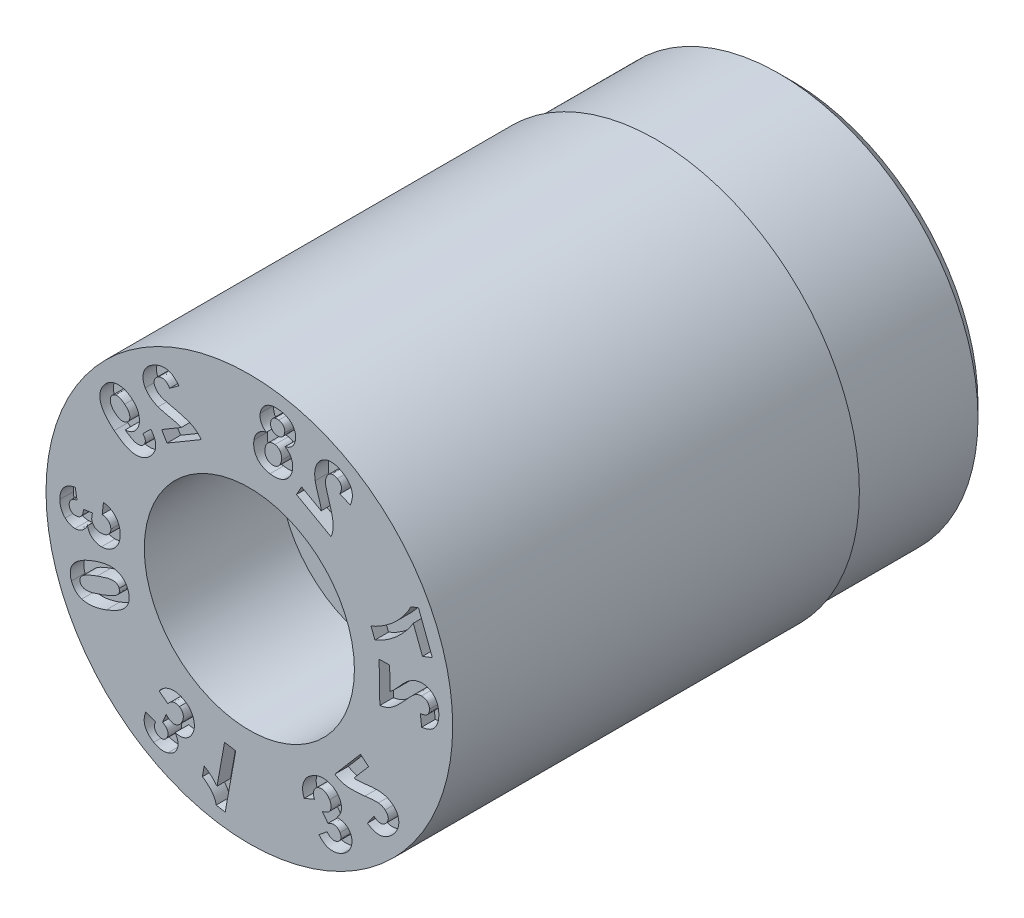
from build123d import *

# Parameters (mm, degrees)
SKETCH4_W          = 2
SKETCH4_H          = 1
CUT_EXTRUDE1_DEPTH = 0.2


with BuildPart() as part:
    # Sketch1 → Revolve1 (revolve)
    with BuildSketch(Plane(origin=(0, 0, 0), x_dir=(0, 0, -1), z_dir=(1, 0, 0)), mode=Mode.PRIVATE) as revolve1_sk:
        Polygon((0, 3), (0, 1.55), (2, 1.55), (2, 0.8), (8, 0.8), (8, 2.75), (7.75, 3), align=None)
    revolve(revolve1_sk.sketch.rotate(Axis((0, 0, 3.797909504), (0, 0, -1)), 90), axis=Axis((0, 0, 3.797909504), (0, 0, -1)))

    # Sketch4 → Cut-Revolve1 (revolve, cut)
    with BuildSketch(Plane(origin=(0, 0, 0), x_dir=(0, 0, -1), z_dir=(1, 0, 0)), mode=Mode.PRIVATE) as cut_revolve1_sk:
        with Locations((7, 3.435)):
            Rectangle(SKETCH4_W, SKETCH4_H)
    revolve(cut_revolve1_sk.sketch.rotate(Axis((0, 0, 0), (0, 0, -1)), 90), axis=Axis((0, 0, 0), (0, 0, -1)), mode=Mode.SUBTRACT)

    # Sketch6 → Cut-Extrude1 (cut)
    # profile 1 of 12: a face of its own
    with BuildSketch(Plane.XY):
        with BuildLine():
            Line((2.06988835, 0.31848086), (1.914579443, 0.315722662))
            Line((1.914579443, 0.315722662), (1.925017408, -0.270430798))
            add(Edge.make_bspline(
                [(1.925017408, -0.270430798), (1.939507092, -0.268087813), (1.968498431, -0.263399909), (2.010959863, -0.250770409), (2.051919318, -0.232928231), (2.085236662, -0.214368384), (2.112197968, -0.196341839), (2.133906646, -0.179470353), (2.157333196, -0.159925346), (2.182287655, -0.13735908), (2.208781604, -0.111869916), (2.236811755, -0.083447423), (2.26641486, -0.052122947), (2.286361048, -0.029991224), (2.296709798, -0.018508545)],
                knots=[0, 0, 0, 0, 1.148146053, 2.297240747, 3.456399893, 4.639264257, 5.277505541, 5.99348973, 6.790258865, 7.665423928, 8.626510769, 9.667826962, 10.789990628, 12, 12, 12, 12], degree=3))
            add(Edge.make_bspline(
                [(2.296709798, -0.018508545), (2.304921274, -0.0093504), (2.320566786, 0.008098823), (2.343444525, 0.032501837), (2.363832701, 0.054571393), (2.382491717, 0.073542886), (2.399120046, 0.089675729), (2.413303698, 0.103427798), (2.425738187, 0.114133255), (2.43355428, 0.120073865), (2.43700804, 0.122698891)],
                knots=[0, 0, 0, 0, 1.481155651, 2.822079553, 4.027920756, 5.099079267, 6.025811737, 6.817938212, 7.477672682, 8, 8, 8, 8], degree=3))
            add(Edge.make_bspline(
                [(2.43700804, 0.122698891), (2.445376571, 0.128151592), (2.461538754, 0.13868242), (2.48740035, 0.14984297), (2.513087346, 0.157239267), (2.530374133, 0.158493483), (2.538854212, 0.159108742)],
                knots=[0, 0, 0, 0, 1.091279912, 2.10759427, 3.071675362, 4, 4, 4, 4], degree=3))
            add(Edge.make_bspline(
                [(2.538854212, 0.159108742), (2.547656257, 0.158892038), (2.564418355, 0.158479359), (2.588145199, 0.153494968), (2.60859292, 0.144135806), (2.625854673, 0.131182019), (2.639538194, 0.114624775), (2.649327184, 0.09495334), (2.655340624, 0.072430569), (2.656264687, 0.056471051), (2.656748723, 0.048111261)],
                knots=[0, 0, 0, 0, 1.147989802, 2.186164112, 3.139850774, 4.061150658, 4.98018042, 5.917217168, 6.909012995, 8, 8, 8, 8], degree=3))
            add(Edge.make_bspline(
                [(2.656748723, 0.048111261), (2.656524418, 0.039775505), (2.656094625, 0.023803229), (2.650802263, 0.000951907), (2.640812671, -0.019030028), (2.629425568, -0.033501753), (2.618393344, -0.04365121), (2.608417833, -0.050046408), (2.597407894, -0.056014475), (2.585060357, -0.061285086), (2.571202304, -0.065331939), (2.556158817, -0.068936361), (2.539812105, -0.071647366), (2.528460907, -0.072728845), (2.522595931, -0.073287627)],
                knots=[0, 0, 0, 0, 1.466735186, 2.810434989, 4.093433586, 5.371159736, 6.032521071, 6.72491028, 7.451728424, 8.238031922, 9.084197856, 9.991651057, 10.962319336, 12, 12, 12, 12], degree=3))
            Line((2.522595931, -0.073287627), (2.542168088, -0.239615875))
            add(Edge.make_bspline(
                [(2.542168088, -0.239615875), (2.553247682, -0.238029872), (2.574769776, -0.234949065), (2.605572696, -0.227566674), (2.633970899, -0.218414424), (2.660050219, -0.207532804), (2.683469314, -0.194234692), (2.704434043, -0.179073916), (2.723095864, -0.162134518), (2.73894333, -0.14299746), (2.752671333, -0.122408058), (2.764556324, -0.10065293), (2.774542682, -0.077663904), (2.782649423, -0.053530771), (2.788773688, -0.028156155), (2.792835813, -0.00156071), (2.795210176, 0.026172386), (2.795293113, 0.045063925), (2.79533524, 0.054659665)],
                knots=[0, 0, 0, 0, 1.23640247, 2.40170996, 3.495311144, 4.531287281, 5.518809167, 6.464380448, 7.385691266, 8.296043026, 9.202704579, 10.117054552, 11.031980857, 11.969130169, 12.927151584, 13.912899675, 14.939881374, 16, 16, 16, 16], degree=3))
            add(Edge.make_bspline(
                [(2.79533524, 0.054659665), (2.794925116, 0.06511605), (2.79412413, 0.085537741), (2.790372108, 0.115320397), (2.784435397, 0.143308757), (2.776420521, 0.169559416), (2.766143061, 0.194017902), (2.753634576, 0.216722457), (2.739045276, 0.237667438), (2.72243145, 0.256637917), (2.704233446, 0.273493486), (2.684923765, 0.288235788), (2.664572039, 0.300671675), (2.643122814, 0.310669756), (2.620631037, 0.318289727), (2.597244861, 0.323863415), (2.572748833, 0.326879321), (2.556107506, 0.326970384), (2.547624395, 0.327016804)],
                knots=[0, 0, 0, 0, 1.213661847, 2.370324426, 3.477678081, 4.529430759, 5.549964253, 6.549980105, 7.531419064, 8.505633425, 9.46975327, 10.404626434, 11.319778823, 12.231420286, 13.144259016, 14.070441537, 15.016385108, 16, 16, 16, 16], degree=3))
            add(Edge.make_bspline(
                [(2.547624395, 0.327016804), (2.537929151, 0.326606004), (2.518652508, 0.325789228), (2.490136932, 0.321324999), (2.462460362, 0.314018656), (2.435242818, 0.304323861), (2.408255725, 0.291433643), (2.381048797, 0.275427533), (2.352969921, 0.256790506), (2.334804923, 0.242417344), (2.325416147, 0.234988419)],
                knots=[0, 0, 0, 0, 0.948465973, 1.885794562, 2.81576617, 3.744458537, 4.707282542, 5.735585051, 6.829612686, 8, 8, 8, 8], degree=3))
            add(Edge.make_bspline(
                [(2.325416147, 0.234988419), (2.322019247, 0.232195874), (2.314790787, 0.226253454), (2.303957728, 0.215965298), (2.291796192, 0.20441668), (2.278552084, 0.191308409), (2.264528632, 0.176366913), (2.249245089, 0.160167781), (2.232917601, 0.142438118), (2.216200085, 0.123548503), (2.199538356, 0.104997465), (2.184151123, 0.087537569), (2.170066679, 0.072092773), (2.157541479, 0.058321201), (2.146409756, 0.046542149), (2.136776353, 0.036550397), (2.12876599, 0.028325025), (2.116325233, 0.016751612), (2.099502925, 0.002076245), (2.083472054, -0.008576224), (2.075849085, -0.013641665)],
                knots=[0, 0, 0, 0, 0.672299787, 1.430625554, 2.28362297, 3.237535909, 4.279724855, 5.417169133, 6.643572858, 7.965519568, 9.274759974, 10.456940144, 11.524544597, 12.471362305, 13.303804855, 14.002897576, 14.594158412, 15.059111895, 16.601554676, 18, 18, 18, 18], degree=3))
            Line((2.075849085, -0.013641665), (2.06988835, 0.31848086))
        make_face()
    # profile 2 of 12: a face of its own
    with BuildSketch(Plane.XY):
        with BuildLine():
            Line((2.554412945, 0.672530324), (2.699728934, 0.728079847))
            Line((2.699728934, 0.728079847), (2.495373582, 1.263063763))
            Line((2.495373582, 1.263063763), (2.381797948, 1.219652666))
            add(Edge.make_bspline(
                [(2.381797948, 1.219652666), (2.378252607, 1.211862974), (2.370994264, 1.195915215), (2.358275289, 1.172046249), (2.344015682, 1.14738181), (2.327787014, 1.122008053), (2.309972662, 1.095842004), (2.290280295, 1.068990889), (2.268989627, 1.041337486), (2.238130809, 1.003601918), (2.197084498, 0.957114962), (2.143901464, 0.904403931), (2.087120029, 0.855186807), (2.037272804, 0.817180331), (1.996462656, 0.788875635), (1.966429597, 0.768881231), (1.936738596, 0.750565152), (1.907478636, 0.733818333), (1.878731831, 0.71839596), (1.850506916, 0.704376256), (1.82275493, 0.691985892), (1.804236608, 0.684730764), (1.795148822, 0.681170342)],
                knots=[0, 0, 0, 0, 0.631264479, 1.292381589, 1.994281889, 2.7326638, 3.513859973, 4.329226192, 5.188842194, 6.088285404, 7.925157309, 9.761133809, 11.608106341, 13.465023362, 14.382330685, 15.271899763, 16.126472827, 16.955461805, 17.758742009, 18.532857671, 19.28000628, 20, 20, 20, 20], degree=3))
            Line((1.795148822, 0.681170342), (1.85276007, 0.530125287))
            add(Edge.make_bspline(
                [(1.85276007, 0.530125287), (1.866711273, 0.536071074), (1.894713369, 0.548005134), (1.935846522, 0.568281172), (1.976626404, 0.5902002), (2.016625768, 0.61466332), (2.056178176, 0.640936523), (2.095292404, 0.669094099), (2.133779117, 0.69938386), (2.171435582, 0.731643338), (2.208183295, 0.765181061), (2.243157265, 0.800053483), (2.276826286, 0.835547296), (2.308625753, 0.872144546), (2.33862327, 0.909755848), (2.366948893, 0.948259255), (2.393765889, 0.987552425), (2.410260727, 1.014569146), (2.418488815, 1.028045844)],
                knots=[0, 0, 0, 0, 0.949957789, 1.906703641, 2.871946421, 3.84957785, 4.842941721, 5.846296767, 6.868194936, 7.910349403, 8.952243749, 9.984323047, 11.003910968, 12.016697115, 13.020754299, 14.01711516, 15.010881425, 16, 16, 16, 16], degree=3))
            Line((2.418488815, 1.028045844), (2.554412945, 0.672530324))
        make_face()
    # profile 3 of 12: a face of its own
    with BuildSketch(Plane.XY):
        with BuildLine():
            Line((0.770950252, 1.946069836), (0.695285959, 1.810883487))
            Line((0.695285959, 1.810883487), (1.205018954, 1.525386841))
            add(Edge.make_bspline(
                [(1.205018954, 1.525386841), (1.210358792, 1.539033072), (1.221034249, 1.566314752), (1.230956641, 1.609300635), (1.236661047, 1.653381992), (1.237442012, 1.691399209), (1.234995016, 1.723650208), (1.231822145, 1.750875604), (1.226451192, 1.780848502), (1.219807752, 1.813731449), (1.21103161, 1.849330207), (1.200642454, 1.887741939), (1.188844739, 1.929052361), (1.179804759, 1.957364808), (1.175122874, 1.972028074)],
                knots=[0, 0, 0, 0, 1.149474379, 2.298040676, 3.453280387, 4.636079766, 5.275905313, 5.992363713, 6.78756556, 7.666341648, 8.626565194, 9.666138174, 10.791272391, 12, 12, 12, 12], degree=3))
            add(Edge.make_bspline(
                [(1.175122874, 1.972028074), (1.171372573, 1.983667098), (1.164212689, 2.005887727), (1.154685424, 2.037819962), (1.146013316, 2.066504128), (1.138993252, 2.092103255), (1.133260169, 2.114528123), (1.128889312, 2.133776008), (1.12563994, 2.149823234), (1.124493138, 2.159540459), (1.123987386, 2.163825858)],
                knots=[0, 0, 0, 0, 1.476652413, 2.819149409, 4.024051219, 5.095266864, 6.024437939, 6.818810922, 7.4790832, 8, 8, 8, 8], degree=3))
            add(Edge.make_bspline(
                [(1.123987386, 2.163825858), (1.123524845, 2.173787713), (1.122632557, 2.193005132), (1.125896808, 2.220846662), (1.132430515, 2.246603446), (1.140120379, 2.261987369), (1.143897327, 2.269543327)],
                knots=[0, 0, 0, 0, 1.095280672, 2.112906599, 3.073136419, 4, 4, 4, 4], degree=3))
            add(Edge.make_bspline(
                [(1.143897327, 2.269543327), (1.148430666, 2.277082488), (1.157057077, 2.291428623), (1.173507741, 2.309171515), (1.19172482, 2.322234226), (1.211653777, 2.330448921), (1.232746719, 2.333940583), (1.254652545, 2.332693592), (1.277090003, 2.326600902), (1.291294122, 2.319345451), (1.298710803, 2.315557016)],
                knots=[0, 0, 0, 0, 1.148981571, 2.186376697, 3.14198494, 4.061156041, 4.98228758, 5.916647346, 6.912177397, 8, 8, 8, 8], degree=3))
            add(Edge.make_bspline(
                [(1.298710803, 2.315557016), (1.305790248, 2.311219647), (1.319399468, 2.302881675), (1.33617192, 2.286541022), (1.348693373, 2.268070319), (1.355346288, 2.250875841), (1.358383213, 2.236249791), (1.359032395, 2.224409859), (1.35867489, 2.211901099), (1.356701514, 2.198660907), (1.353419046, 2.184712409), (1.349020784, 2.169957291), (1.343130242, 2.154533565), (1.338289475, 2.144240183), (1.335785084, 2.138914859)],
                knots=[0, 0, 0, 0, 1.462368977, 2.8111953, 4.098813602, 5.374842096, 6.037906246, 6.729421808, 7.463233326, 8.244371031, 9.088117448, 9.991985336, 10.961145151, 12, 12, 12, 12], degree=3))
            Line((1.335785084, 2.138914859), (1.48887001, 2.072169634))
            add(Edge.make_bspline(
                [(1.48887001, 2.072169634), (1.493070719, 2.082508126), (1.501237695, 2.102608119), (1.510252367, 2.132906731), (1.516951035, 2.161971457), (1.52025988, 2.189936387), (1.520899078, 2.21674802), (1.51820035, 2.2423297), (1.512894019, 2.266861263), (1.504486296, 2.290164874), (1.493671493, 2.312368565), (1.480917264, 2.333556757), (1.465998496, 2.353587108), (1.449365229, 2.372746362), (1.430535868, 2.39067578), (1.40992625, 2.407705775), (1.387280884, 2.423703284), (1.37103194, 2.43318253), (1.362743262, 2.438017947)],
                knots=[0, 0, 0, 0, 1.236660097, 2.404302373, 3.500946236, 4.539864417, 5.521294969, 6.468386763, 7.38530318, 8.297694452, 9.207919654, 10.120101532, 11.035604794, 11.973915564, 12.929996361, 13.914881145, 14.936369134, 16, 16, 16, 16], degree=3))
            add(Edge.make_bspline(
                [(1.362743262, 2.438017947), (1.353533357, 2.44294256), (1.335549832, 2.452558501), (1.308045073, 2.46427681), (1.280946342, 2.473215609), (1.254356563, 2.479625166), (1.2280951, 2.482812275), (1.202328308, 2.483714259), (1.176931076, 2.4816788), (1.152275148, 2.476730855), (1.128546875, 2.469716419), (1.10624372, 2.460269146), (1.08520389, 2.449185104), (1.065754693, 2.435757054), (1.04791098, 2.420212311), (1.031607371, 2.402592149), (1.016575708, 2.383149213), (1.008095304, 2.368870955), (1.003797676, 2.361635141)],
                knots=[0, 0, 0, 0, 1.214941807, 2.372330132, 3.473764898, 4.532690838, 5.54935427, 6.546959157, 7.528617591, 8.506625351, 9.468629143, 10.402867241, 11.32079676, 12.231515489, 13.146587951, 14.068989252, 15.021418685, 16, 16, 16, 16], degree=3))
            add(Edge.make_bspline(
                [(1.003797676, 2.361635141), (0.999299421, 2.353051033), (0.990396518, 2.336061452), (0.979933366, 2.309324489), (0.972071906, 2.281937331), (0.96688685, 2.253568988), (0.964229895, 2.223882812), (0.964196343, 2.192408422), (0.966236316, 2.158899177), (0.969526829, 2.136040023), (0.971225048, 2.124242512)],
                knots=[0, 0, 0, 0, 0.950713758, 1.881643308, 2.812429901, 3.74360957, 4.707994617, 5.733907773, 6.830479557, 8, 8, 8, 8], degree=3))
            add(Edge.make_bspline(
                [(0.971225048, 2.124242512), (0.971977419, 2.119954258), (0.973593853, 2.110741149), (0.976550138, 2.096064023), (0.980759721, 2.079775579), (0.985263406, 2.06173541), (0.991030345, 2.042157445), (0.997171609, 2.020829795), (1.004545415, 1.997912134), (1.012199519, 1.973936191), (1.019933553, 1.950254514), (1.027062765, 1.928159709), (1.033504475, 1.908299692), (1.039045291, 1.890647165), (1.043485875, 1.875090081), (1.047440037, 1.861863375), (1.050267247, 1.850742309), (1.054238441, 1.834385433), (1.058129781, 1.812521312), (1.059206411, 1.793426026), (1.059720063, 1.784315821)],
                knots=[0, 0, 0, 0, 0.667728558, 1.434583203, 2.295297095, 3.247401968, 4.285995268, 5.424951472, 6.651125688, 7.977858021, 9.284948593, 10.471812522, 11.538451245, 12.487052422, 13.309059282, 14.019624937, 14.604006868, 15.068532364, 16.601420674, 18, 18, 18, 18], degree=3))
            Line((1.059720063, 1.784315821), (0.770950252, 1.946069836))
        make_face()
    # profile 4 of 12: a face of its own
    with BuildSketch(Plane.XY):
        with BuildLine():
            add(Edge.make_bspline(
                [(0.527276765, 2.337607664), (0.53289982, 2.339046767), (0.543842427, 2.341847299), (0.559554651, 2.347308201), (0.574334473, 2.35340061), (0.588067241, 2.360581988), (0.600969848, 2.368197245), (0.612691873, 2.376898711), (0.623565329, 2.38622856), (0.636472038, 2.399913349), (0.650521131, 2.418369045), (0.663618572, 2.442663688), (0.674000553, 2.46841988), (0.677581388, 2.486676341), (0.679392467, 2.495909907)],
                knots=[0, 0, 0, 0, 0.892458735, 1.736747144, 2.556437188, 3.3490686, 4.11868996, 4.858432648, 5.591685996, 6.319571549, 7.748722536, 9.144118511, 10.555581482, 12, 12, 12, 12], degree=3))
            add(Edge.make_bspline(
                [(0.679392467, 2.495909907), (0.680499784, 2.503825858), (0.682673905, 2.519368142), (0.683083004, 2.54254777), (0.681615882, 2.565068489), (0.677642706, 2.586899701), (0.671196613, 2.608025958), (0.66267788, 2.628419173), (0.651759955, 2.648094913), (0.638663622, 2.66696757), (0.62343029, 2.684845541), (0.605686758, 2.700830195), (0.58611673, 2.715331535), (0.564348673, 2.728079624), (0.540433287, 2.739002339), (0.514540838, 2.748564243), (0.48647295, 2.756076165), (0.466966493, 2.759740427), (0.456950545, 2.761621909)],
                knots=[0, 0, 0, 0, 0.981415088, 1.926923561, 2.842853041, 3.751093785, 4.646732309, 5.552213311, 6.461974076, 7.406461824, 8.371158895, 9.341138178, 10.334487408, 11.359787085, 12.43468914, 13.561500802, 14.747907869, 16, 16, 16, 16], degree=3))
            add(Edge.make_bspline(
                [(0.456950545, 2.761621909), (0.446919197, 2.763053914), (0.427415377, 2.765838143), (0.398680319, 2.767493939), (0.371315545, 2.76705085), (0.345297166, 2.76444237), (0.320631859, 2.759239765), (0.297400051, 2.751842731), (0.275582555, 2.742135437), (0.255221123, 2.730481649), (0.236742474, 2.716722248), (0.2197207, 2.701818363), (0.205086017, 2.685033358), (0.191971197, 2.667232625), (0.181177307, 2.647805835), (0.172398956, 2.627026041), (0.165119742, 2.604966), (0.162227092, 2.589532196), (0.160754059, 2.581672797)],
                knots=[0, 0, 0, 0, 1.24610695, 2.422789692, 3.536295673, 4.610147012, 5.634158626, 6.631728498, 7.60375044, 8.566644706, 9.511184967, 10.433784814, 11.344040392, 12.24486152, 13.149387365, 14.070258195, 15.017312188, 16, 16, 16, 16], degree=3))
            add(Edge.make_bspline(
                [(0.160754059, 2.581672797), (0.159482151, 2.571846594), (0.156985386, 2.552557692), (0.158461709, 2.523646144), (0.164077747, 2.495810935), (0.173760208, 2.469189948), (0.18738981, 2.44418801), (0.204814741, 2.421294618), (0.225790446, 2.400533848), (0.24209267, 2.389154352), (0.250409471, 2.383348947)],
                knots=[0, 0, 0, 0, 1.027664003, 2.017311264, 2.991053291, 3.968252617, 4.948878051, 5.937677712, 6.947878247, 8, 8, 8, 8], degree=3))
            add(Edge.make_bspline(
                [(0.250409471, 2.383348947), (0.244154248, 2.381883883), (0.231843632, 2.379000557), (0.21405771, 2.373216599), (0.197191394, 2.36644944), (0.181323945, 2.358582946), (0.166359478, 2.349761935), (0.152215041, 2.340103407), (0.139205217, 2.329073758), (0.127065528, 2.317262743), (0.115831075, 2.304681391), (0.105968, 2.291139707), (0.096807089, 2.2771313), (0.089044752, 2.262175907), (0.082257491, 2.246561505), (0.076577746, 2.230199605), (0.071877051, 2.213127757), (0.069682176, 2.201398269), (0.068570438, 2.195457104)],
                knots=[0, 0, 0, 0, 1.104394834, 2.173508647, 3.212544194, 4.227167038, 5.215794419, 6.197997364, 7.168487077, 8.144641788, 9.109274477, 10.064760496, 11.023020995, 11.984897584, 12.95832882, 13.948658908, 14.960964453, 16, 16, 16, 16], degree=3))
            add(Edge.make_bspline(
                [(0.068570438, 2.195457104), (0.067173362, 2.185650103), (0.064443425, 2.166486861), (0.063556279, 2.137931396), (0.064881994, 2.110391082), (0.069265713, 2.083837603), (0.076139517, 2.058307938), (0.085568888, 2.033788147), (0.097817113, 2.010339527), (0.112438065, 1.988028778), (0.129360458, 1.9671837), (0.148504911, 1.948485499), (0.169314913, 1.931540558), (0.192462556, 1.917242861), (0.21722213, 1.90437576), (0.244266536, 1.894196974), (0.273058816, 1.885595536), (0.293150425, 1.8818701), (0.303405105, 1.879968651)],
                knots=[0, 0, 0, 0, 1.073069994, 2.096818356, 3.091562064, 4.057501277, 5.007943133, 5.953162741, 6.899176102, 7.87012168, 8.840356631, 9.803245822, 10.766472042, 11.742855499, 12.747259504, 13.786466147, 14.87022083, 16, 16, 16, 16], degree=3))
            add(Edge.make_bspline(
                [(0.303405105, 1.879968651), (0.313063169, 1.878514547), (0.332017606, 1.875660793), (0.360231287, 1.874335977), (0.387484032, 1.874672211), (0.41379877, 1.877467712), (0.439324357, 1.881933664), (0.463822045, 1.889066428), (0.487548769, 1.897916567), (0.502447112, 1.90567293), (0.509898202, 1.90955211)],
                knots=[0, 0, 0, 0, 1.101902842, 2.162539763, 3.18438132, 4.175864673, 5.146831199, 6.105483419, 7.052497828, 8, 8, 8, 8], degree=3))
            add(Edge.make_bspline(
                [(0.509898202, 1.90955211), (0.518284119, 1.914584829), (0.534794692, 1.924493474), (0.557341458, 1.942196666), (0.576994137, 1.96231816), (0.59408632, 1.984595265), (0.608732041, 2.008917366), (0.620330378, 2.035605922), (0.62985337, 2.064220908), (0.633610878, 2.084359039), (0.635534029, 2.094666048)],
                knots=[0, 0, 0, 0, 1.010881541, 1.990269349, 2.955238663, 3.912367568, 4.888657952, 5.883481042, 6.916732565, 8, 8, 8, 8], degree=3))
            add(Edge.make_bspline(
                [(0.635534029, 2.094666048), (0.637053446, 2.106217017), (0.640056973, 2.129050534), (0.638629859, 2.163365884), (0.633146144, 2.196913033), (0.624585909, 2.223992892), (0.615438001, 2.244984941), (0.606915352, 2.260134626), (0.597007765, 2.274648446), (0.585996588, 2.288694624), (0.573296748, 2.301877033), (0.559447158, 2.314613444), (0.543946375, 2.326532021), (0.532918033, 2.333859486), (0.527276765, 2.337607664)],
                knots=[0, 0, 0, 0, 1.478319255, 2.922285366, 4.345613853, 5.788556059, 6.517984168, 7.252934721, 7.993780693, 8.749865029, 9.518205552, 10.317428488, 11.1393233, 12, 12, 12, 12], degree=3))
        make_face()
        with BuildLine():
            add(Edge.make_bspline(
                [(0.520631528, 2.510112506), (0.519074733, 2.502339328), (0.516100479, 2.487488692), (0.507114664, 2.46741093), (0.495507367, 2.450301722), (0.48052613, 2.436898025), (0.463155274, 2.427173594), (0.443772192, 2.421406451), (0.422676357, 2.419414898), (0.408315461, 2.421244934), (0.400860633, 2.422194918)],
                knots=[0, 0, 0, 0, 1.128861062, 2.156686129, 3.117931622, 4.060875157, 4.999515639, 5.937856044, 6.929528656, 8, 8, 8, 8], degree=3))
            add(Edge.make_bspline(
                [(0.400860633, 2.422194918), (0.393449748, 2.423720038), (0.379145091, 2.42666386), (0.359602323, 2.435348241), (0.342976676, 2.447170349), (0.329532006, 2.462111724), (0.319524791, 2.479721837), (0.313570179, 2.49973702), (0.311831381, 2.521788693), (0.313667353, 2.536866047), (0.314626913, 2.544746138)],
                knots=[0, 0, 0, 0, 1.069749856, 2.064855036, 3.005185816, 3.940933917, 4.890363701, 5.851551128, 6.877125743, 8, 8, 8, 8], degree=3))
            add(Edge.make_bspline(
                [(0.314626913, 2.544746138), (0.316108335, 2.5521133), (0.318956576, 2.566277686), (0.32787799, 2.585452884), (0.339505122, 2.601999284), (0.354600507, 2.614958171), (0.371742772, 2.625077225), (0.391063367, 2.63089602), (0.411944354, 2.633064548), (0.426094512, 2.631298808), (0.433440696, 2.630382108)],
                knots=[0, 0, 0, 0, 1.090205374, 2.09607067, 3.053696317, 4.011589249, 4.968985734, 5.930384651, 6.925540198, 8, 8, 8, 8], degree=3))
            add(Edge.make_bspline(
                [(0.433440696, 2.630382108), (0.440960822, 2.628816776), (0.455426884, 2.625805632), (0.475241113, 2.617097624), (0.491937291, 2.604994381), (0.505385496, 2.589975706), (0.51532077, 2.572534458), (0.521242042, 2.553097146), (0.523461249, 2.5319549), (0.521597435, 2.517568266), (0.520631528, 2.510112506)],
                knots=[0, 0, 0, 0, 1.098549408, 2.113220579, 3.074646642, 4.03237831, 4.980586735, 5.927148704, 6.92576104, 8, 8, 8, 8], degree=3))
        make_face(mode=Mode.SUBTRACT)
        with BuildLine():
            add(Edge.make_bspline(
                [(0.474884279, 2.137418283), (0.473825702, 2.131891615), (0.47176996, 2.121158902), (0.467746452, 2.105610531), (0.462524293, 2.091308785), (0.456372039, 2.078071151), (0.44935988, 2.06596754), (0.441326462, 2.054964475), (0.432374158, 2.045080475), (0.422589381, 2.036314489), (0.412036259, 2.028950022), (0.401144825, 2.022630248), (0.389841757, 2.017769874), (0.37821941, 2.014093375), (0.366248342, 2.011834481), (0.353922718, 2.010795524), (0.34126126, 2.010863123), (0.332819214, 2.012086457), (0.328537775, 2.012706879)],
                knots=[0, 0, 0, 0, 1.249195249, 2.42591978, 3.561200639, 4.624409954, 5.663166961, 6.661657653, 7.643215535, 8.61894758, 9.571377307, 10.495510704, 11.409924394, 12.297131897, 13.196816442, 14.108153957, 15.040537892, 16, 16, 16, 16], degree=3))
            add(Edge.make_bspline(
                [(0.328537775, 2.012706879), (0.32042009, 2.014538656), (0.304534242, 2.01812334), (0.282715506, 2.028862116), (0.264277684, 2.044285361), (0.251455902, 2.060033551), (0.243095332, 2.074508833), (0.238277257, 2.086565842), (0.234291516, 2.099283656), (0.231594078, 2.112896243), (0.230460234, 2.127401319), (0.230159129, 2.142682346), (0.231394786, 2.158805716), (0.232927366, 2.169736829), (0.233717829, 2.175374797)],
                knots=[0, 0, 0, 0, 1.409178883, 2.757682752, 4.080303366, 5.46106437, 6.181672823, 6.909766, 7.659931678, 8.441784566, 9.259034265, 10.126532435, 11.033716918, 12, 12, 12, 12], degree=3))
            add(Edge.make_bspline(
                [(0.233717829, 2.175374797), (0.23462375, 2.180330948), (0.236386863, 2.189976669), (0.24032212, 2.203845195), (0.245287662, 2.216720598), (0.25092438, 2.228873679), (0.257895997, 2.239888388), (0.265638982, 2.250024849), (0.274157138, 2.259410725), (0.283825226, 2.267505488), (0.294008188, 2.274761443), (0.304826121, 2.280499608), (0.315759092, 2.28556731), (0.327295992, 2.288939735), (0.339144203, 2.291020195), (0.351355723, 2.292011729), (0.363914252, 2.291687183), (0.372339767, 2.290501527), (0.376621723, 2.289898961)],
                knots=[0, 0, 0, 0, 1.17530162, 2.287386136, 3.357769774, 4.393602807, 5.408066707, 6.392426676, 7.368441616, 8.358515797, 9.329411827, 10.280446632, 11.21210518, 12.136672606, 13.07566914, 14.015566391, 14.991484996, 16, 16, 16, 16], degree=3))
            add(Edge.make_bspline(
                [(0.376621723, 2.289898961), (0.381506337, 2.2889656), (0.391011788, 2.28714928), (0.404529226, 2.283008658), (0.416833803, 2.277503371), (0.428000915, 2.270980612), (0.438068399, 2.263348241), (0.446653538, 2.2542809), (0.454323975, 2.244326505), (0.462545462, 2.229565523), (0.470226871, 2.210115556), (0.475824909, 2.186087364), (0.477803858, 2.161658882), (0.475862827, 2.145542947), (0.474884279, 2.137418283)],
                knots=[0, 0, 0, 0, 0.878634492, 1.709821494, 2.492201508, 3.256092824, 3.991856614, 4.716540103, 5.456908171, 6.207334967, 7.695556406, 9.136749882, 10.556525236, 12, 12, 12, 12], degree=3))
        make_face(mode=Mode.SUBTRACT)
    # profile 5 of 12: a face of its own
    with BuildSketch(Plane.XY):
        with BuildLine():
            Line((-1.293531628, 1.646481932), (-1.214767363, 1.512663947))
            Line((-1.214767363, 1.512663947), (-0.709860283, 1.809692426))
            add(Edge.make_bspline(
                [(-0.709860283, 1.809692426), (-0.719002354, 1.821195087), (-0.737261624, 1.844169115), (-0.769487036, 1.874492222), (-0.804876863, 1.901634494), (-0.837402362, 1.921606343), (-0.866387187, 1.936105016), (-0.891696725, 1.946711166), (-0.920218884, 1.957499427), (-0.95212013, 1.968110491), (-0.987402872, 1.978463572), (-1.025890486, 1.98892324), (-1.067670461, 1.999449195), (-1.09672388, 2.005945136), (-1.111769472, 2.009309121)],
                knots=[0, 0, 0, 0, 1.1497544, 2.296380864, 3.455139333, 4.639220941, 5.279648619, 5.992342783, 6.78784171, 7.668094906, 8.625209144, 9.667952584, 10.792326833, 12, 12, 12, 12], degree=3))
            add(Edge.make_bspline(
                [(-1.111769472, 2.009309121), (-1.123787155, 2.011973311), (-1.146648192, 2.017041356), (-1.179126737, 2.024805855), (-1.208245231, 2.031995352), (-1.233889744, 2.038878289), (-1.256237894, 2.045001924), (-1.275024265, 2.051057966), (-1.290509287, 2.056443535), (-1.299499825, 2.060331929), (-1.303461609, 2.062045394)],
                knots=[0, 0, 0, 0, 1.484095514, 2.82317009, 4.026143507, 5.1000705, 6.024583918, 6.819329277, 7.479723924, 8, 8, 8, 8], degree=3))
            add(Edge.make_bspline(
                [(-1.303461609, 2.062045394), (-1.31225524, 2.066688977), (-1.329290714, 2.075684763), (-1.351808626, 2.092476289), (-1.370840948, 2.111241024), (-1.380283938, 2.125724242), (-1.384931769, 2.132852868)],
                knots=[0, 0, 0, 0, 1.088756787, 2.109195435, 3.069347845, 4, 4, 4, 4], degree=3))
            add(Edge.make_bspline(
                [(-1.384931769, 2.132852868), (-1.389084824, 2.140607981), (-1.396970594, 2.155333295), (-1.404340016, 2.17841571), (-1.406355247, 2.200827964), (-1.403343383, 2.222221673), (-1.395730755, 2.242183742), (-1.383616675, 2.260464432), (-1.367055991, 2.276926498), (-1.353531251, 2.28559034), (-1.346456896, 2.290122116)],
                knots=[0, 0, 0, 0, 1.147311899, 2.178501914, 3.140501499, 4.061119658, 4.975963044, 5.907043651, 6.905242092, 8, 8, 8, 8], degree=3))
            add(Edge.make_bspline(
                [(-1.346456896, 2.290122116), (-1.339119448, 2.294081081), (-1.325034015, 2.301680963), (-1.302416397, 2.307786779), (-1.280164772, 2.309441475), (-1.2619456, 2.306476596), (-1.24777135, 2.301620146), (-1.237212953, 2.296242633), (-1.226599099, 2.28956207), (-1.216101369, 2.281241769), (-1.205613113, 2.271351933), (-1.195283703, 2.259854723), (-1.184776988, 2.247024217), (-1.178233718, 2.237654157), (-1.174846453, 2.232803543)],
                knots=[0, 0, 0, 0, 1.464510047, 2.811366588, 4.091954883, 5.368982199, 6.030976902, 6.725205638, 7.45097528, 8.237193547, 9.080741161, 9.987465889, 10.958168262, 12, 12, 12, 12], degree=3))
            Line((-1.174846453, 2.232803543), (-1.039840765, 2.331875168))
            add(Edge.make_bspline(
                [(-1.039840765, 2.331875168), (-1.046666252, 2.340756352), (-1.059903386, 2.357980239), (-1.081421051, 2.381209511), (-1.103371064, 2.401412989), (-1.125900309, 2.418387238), (-1.148802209, 2.432368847), (-1.172115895, 2.443467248), (-1.196134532, 2.451020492), (-1.220527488, 2.455615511), (-1.245200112, 2.457438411), (-1.26996799, 2.457132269), (-1.294885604, 2.454360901), (-1.319885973, 2.449602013), (-1.344942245, 2.442296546), (-1.370126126, 2.433049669), (-1.395364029, 2.421412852), (-1.411752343, 2.412116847), (-1.420092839, 2.407385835)],
                knots=[0, 0, 0, 0, 1.238732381, 2.402358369, 3.498289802, 4.535390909, 5.517848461, 6.462763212, 7.384583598, 8.295333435, 9.203015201, 10.117447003, 11.031925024, 11.973366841, 12.929553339, 13.916067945, 14.939425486, 16, 16, 16, 16], degree=3))
            add(Edge.make_bspline(
                [(-1.420092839, 2.407385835), (-1.429018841, 2.401867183), (-1.446402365, 2.391119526), (-1.470474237, 2.373304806), (-1.491998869, 2.354458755), (-1.510700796, 2.334420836), (-1.527107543, 2.313583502), (-1.540730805, 2.291592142), (-1.551671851, 2.268538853), (-1.560061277, 2.244742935), (-1.565712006, 2.220605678), (-1.569293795, 2.196541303), (-1.569934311, 2.172697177), (-1.568152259, 2.149094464), (-1.563993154, 2.125733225), (-1.557055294, 2.102731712), (-1.547714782, 2.079935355), (-1.53966518, 2.06539991), (-1.535548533, 2.057966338)],
                knots=[0, 0, 0, 0, 1.21770937, 2.371507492, 3.47172616, 4.533755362, 5.548588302, 6.545546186, 7.529635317, 8.505178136, 9.468314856, 10.403141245, 11.324407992, 12.230553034, 13.146680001, 14.072731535, 15.014375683, 16, 16, 16, 16], degree=3))
            add(Edge.make_bspline(
                [(-1.535548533, 2.057966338), (-1.530397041, 2.049740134), (-1.520208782, 2.033470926), (-1.502234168, 2.011003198), (-1.482581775, 1.990315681), (-1.46051934, 1.971694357), (-1.436265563, 1.954296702), (-1.409019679, 1.938391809), (-1.378950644, 1.923266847), (-1.357569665, 1.914481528), (-1.346527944, 1.909944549)],
                knots=[0, 0, 0, 0, 0.950449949, 1.879733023, 2.814068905, 3.742334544, 4.704434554, 5.735552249, 6.830577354, 8, 8, 8, 8], degree=3))
            add(Edge.make_bspline(
                [(-1.346527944, 1.909944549), (-1.342424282, 1.908366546), (-1.333630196, 1.904984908), (-1.31933934, 1.900328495), (-1.303197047, 1.895730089), (-1.285306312, 1.890587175), (-1.265507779, 1.885438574), (-1.243794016, 1.880302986), (-1.220294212, 1.87494859), (-1.195689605, 1.869537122), (-1.171282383, 1.864280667), (-1.148516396, 1.859339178), (-1.12811579, 1.854625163), (-1.110007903, 1.850461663), (-1.094211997, 1.846755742), (-1.080775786, 1.843368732), (-1.069711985, 1.84026655), (-1.053519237, 1.835399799), (-1.03262118, 1.827650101), (-1.015563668, 1.818902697), (-1.007443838, 1.814738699)],
                knots=[0, 0, 0, 0, 0.672367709, 1.44087375, 2.297736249, 3.239474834, 4.287950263, 5.426183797, 6.65205271, 7.974285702, 9.279302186, 10.470687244, 11.53730208, 12.481695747, 13.312522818, 14.018812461, 14.600839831, 15.069732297, 16.605114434, 18, 18, 18, 18], degree=3))
            Line((-1.007443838, 1.814738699), (-1.293531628, 1.646481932))
        make_face()
    # profile 6 of 12: a face of its own
    with BuildSketch(Plane.XY):
        with BuildLine():
            Line((-1.454288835, 1.569117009), (-1.571112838, 1.45606378))
            add(Edge.make_bspline(
                [(-1.571112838, 1.45606378), (-1.565902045, 1.450224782), (-1.556062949, 1.4391995), (-1.544820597, 1.42129179), (-1.537112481, 1.403658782), (-1.53398562, 1.385938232), (-1.534483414, 1.368527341), (-1.53878971, 1.351554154), (-1.546680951, 1.334939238), (-1.554286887, 1.324991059), (-1.558258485, 1.31979641)],
                knots=[0, 0, 0, 0, 1.229337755, 2.321254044, 3.313082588, 4.237652, 5.128126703, 6.034065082, 6.973446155, 8, 8, 8, 8], degree=3))
            add(Edge.make_bspline(
                [(-1.558258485, 1.31979641), (-1.561083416, 1.316675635), (-1.566682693, 1.310489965), (-1.576121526, 1.3022872), (-1.586592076, 1.295733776), (-1.597729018, 1.290204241), (-1.609888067, 1.286456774), (-1.622736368, 1.283514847), (-1.636509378, 1.282330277), (-1.65120418, 1.282141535), (-1.66747431, 1.284013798), (-1.685321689, 1.288914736), (-1.705143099, 1.296276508), (-1.726942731, 1.306120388), (-1.750455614, 1.319050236), (-1.776036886, 1.334371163), (-1.803647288, 1.352183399), (-1.822331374, 1.365496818), (-1.832078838, 1.372442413)],
                knots=[0, 0, 0, 0, 0.655292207, 1.298850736, 1.939474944, 2.574321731, 3.229230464, 3.915787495, 4.623307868, 5.37712833, 6.201973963, 7.163901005, 8.251466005, 9.49291507, 10.884926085, 12.427596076, 14.136281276, 16, 16, 16, 16], degree=3))
            add(Edge.make_bspline(
                [(-1.832078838, 1.372442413), (-1.824211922, 1.372825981), (-1.80876726, 1.373579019), (-1.786190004, 1.377340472), (-1.764852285, 1.383402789), (-1.744499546, 1.39154802), (-1.725488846, 1.402278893), (-1.707384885, 1.414909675), (-1.690496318, 1.429831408), (-1.680534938, 1.441300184), (-1.675467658, 1.447134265)],
                knots=[0, 0, 0, 0, 1.053326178, 2.067934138, 3.054614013, 4.016866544, 4.994070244, 5.968898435, 6.966793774, 8, 8, 8, 8], degree=3))
            add(Edge.make_bspline(
                [(-1.675467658, 1.447134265), (-1.670259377, 1.453789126), (-1.660017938, 1.466875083), (-1.647480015, 1.4882276), (-1.637310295, 1.510325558), (-1.629281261, 1.533269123), (-1.624228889, 1.557266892), (-1.621368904, 1.582070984), (-1.621078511, 1.607803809), (-1.62328442, 1.634114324), (-1.627844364, 1.660538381), (-1.635367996, 1.686332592), (-1.645284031, 1.711352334), (-1.658127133, 1.735411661), (-1.673277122, 1.758801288), (-1.691413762, 1.781140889), (-1.711999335, 1.802763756), (-1.727350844, 1.816055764), (-1.73518236, 1.822836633)],
                knots=[0, 0, 0, 0, 0.954794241, 1.877484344, 2.79209907, 3.702867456, 4.619917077, 5.55941945, 6.522502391, 7.524923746, 8.541712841, 9.549428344, 10.558129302, 11.579705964, 12.628623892, 13.704742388, 14.82908288, 16, 16, 16, 16], degree=3))
            add(Edge.make_bspline(
                [(-1.73518236, 1.822836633), (-1.743611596, 1.829567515), (-1.760069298, 1.842709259), (-1.786282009, 1.859278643), (-1.812605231, 1.873274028), (-1.839355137, 1.884176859), (-1.866394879, 1.892355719), (-1.893809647, 1.897254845), (-1.921570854, 1.899756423), (-1.949398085, 1.898680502), (-1.976954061, 1.895428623), (-2.003507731, 1.888987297), (-2.02912643, 1.880251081), (-2.053435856, 1.868505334), (-2.076814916, 1.85427063), (-2.099088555, 1.837482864), (-2.120181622, 1.8178578), (-2.132980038, 1.803203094), (-2.139523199, 1.795710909)],
                knots=[0, 0, 0, 0, 1.136530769, 2.219025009, 3.263992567, 4.276139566, 5.259823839, 6.236616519, 7.207635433, 8.192567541, 9.167216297, 10.128481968, 11.067733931, 12.015953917, 12.968757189, 13.949588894, 14.951731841, 16, 16, 16, 16], degree=3))
            add(Edge.make_bspline(
                [(-2.139523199, 1.795710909), (-2.146126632, 1.787193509), (-2.159108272, 1.770449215), (-2.17531243, 1.743566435), (-2.187858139, 1.715621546), (-2.197233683, 1.686880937), (-2.202948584, 1.657141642), (-2.20515046, 1.626532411), (-2.204216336, 1.595029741), (-2.199673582, 1.562616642), (-2.191053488, 1.529405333), (-2.177397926, 1.495636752), (-2.158860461, 1.461363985), (-2.135274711, 1.42663945), (-2.10706871, 1.391254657), (-2.074032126, 1.355318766), (-2.036108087, 1.318831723), (-2.008369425, 1.295310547), (-1.993975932, 1.283105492)],
                knots=[0, 0, 0, 0, 0.858662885, 1.68803897, 2.495075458, 3.295861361, 4.092650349, 4.90283467, 5.737643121, 6.600588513, 7.50671093, 8.465819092, 9.496965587, 10.607189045, 11.807783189, 13.101283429, 14.495866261, 16, 16, 16, 16], degree=3))
            add(Edge.make_bspline(
                [(-1.993975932, 1.283105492), (-1.979056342, 1.27100499), (-1.950254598, 1.247645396), (-1.906154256, 1.216997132), (-1.863939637, 1.190502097), (-1.822939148, 1.168995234), (-1.783330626, 1.152409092), (-1.745170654, 1.140247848), (-1.708321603, 1.133389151), (-1.672905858, 1.130932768), (-1.639052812, 1.133083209), (-1.606635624, 1.138165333), (-1.575747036, 1.147003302), (-1.546314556, 1.159070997), (-1.518291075, 1.174545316), (-1.491829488, 1.19352959), (-1.466829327, 1.215920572), (-1.451921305, 1.233016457), (-1.44433078, 1.241720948)],
                knots=[0, 0, 0, 0, 1.476778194, 2.850868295, 4.126928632, 5.30760603, 6.406743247, 7.425591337, 8.381370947, 9.282283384, 10.148248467, 10.984524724, 11.801108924, 12.612877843, 13.425966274, 14.25695176, 15.112514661, 16, 16, 16, 16], degree=3))
            add(Edge.make_bspline(
                [(-1.44433078, 1.241720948), (-1.43914775, 1.248239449), (-1.429049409, 1.260939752), (-1.415835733, 1.280839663), (-1.404707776, 1.300863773), (-1.39575982, 1.321155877), (-1.388867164, 1.341521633), (-1.383796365, 1.361993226), (-1.381088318, 1.382680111), (-1.380628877, 1.403472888), (-1.381954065, 1.424360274), (-1.385837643, 1.445161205), (-1.391799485, 1.465954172), (-1.39995743, 1.486730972), (-1.410198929, 1.507538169), (-1.422712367, 1.528303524), (-1.437415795, 1.549010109), (-1.448574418, 1.562307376), (-1.454288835, 1.569117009)],
                knots=[0, 0, 0, 0, 1.102535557, 2.148121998, 3.159466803, 4.133008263, 5.080893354, 6.003819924, 6.921745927, 7.837591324, 8.754593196, 9.688478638, 10.633996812, 11.615437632, 12.640610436, 13.701748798, 14.823047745, 16, 16, 16, 16], degree=3))
        make_face()
        with BuildLine():
            add(Edge.make_bspline(
                [(-1.975774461, 1.51070665), (-1.980712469, 1.514988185), (-1.990343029, 1.523338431), (-2.003635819, 1.536358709), (-2.015241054, 1.5496908), (-2.025168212, 1.563236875), (-2.03365202, 1.576883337), (-2.040168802, 1.590843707), (-2.045534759, 1.604806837), (-2.048849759, 1.619000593), (-2.050749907, 1.632859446), (-2.051545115, 1.646238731), (-2.050952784, 1.658980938), (-2.049104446, 1.671193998), (-2.046021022, 1.68277898), (-2.041179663, 1.693620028), (-2.035665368, 1.704159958), (-2.030711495, 1.710409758), (-2.028226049, 1.713545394)],
                knots=[0, 0, 0, 0, 1.344978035, 2.623100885, 3.826183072, 4.978406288, 6.076820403, 7.126969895, 8.144940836, 9.149897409, 10.118615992, 11.021697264, 11.904632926, 12.738496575, 13.560613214, 14.362282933, 15.178328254, 16, 16, 16, 16], degree=3))
            add(Edge.make_bspline(
                [(-2.028226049, 1.713545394), (-2.023169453, 1.719013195), (-2.013268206, 1.729719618), (-1.994436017, 1.741030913), (-1.973583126, 1.748180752), (-1.954649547, 1.749997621), (-1.938674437, 1.749118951), (-1.925923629, 1.746582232), (-1.912686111, 1.742406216), (-1.899012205, 1.736411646), (-1.884658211, 1.729187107), (-1.869998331, 1.71991047), (-1.854650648, 1.709312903), (-1.844665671, 1.701136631), (-1.839505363, 1.696911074)],
                knots=[0, 0, 0, 0, 1.249376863, 2.446386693, 3.656103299, 4.937892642, 5.622240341, 6.346596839, 7.121743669, 7.956496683, 8.859554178, 9.82655741, 10.876749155, 12, 12, 12, 12], degree=3))
            add(Edge.make_bspline(
                [(-1.839505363, 1.696911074), (-1.834289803, 1.692515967), (-1.82419903, 1.684012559), (-1.810550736, 1.670628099), (-1.798608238, 1.657383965), (-1.788307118, 1.644287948), (-1.779842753, 1.631181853), (-1.773192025, 1.618132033), (-1.768109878, 1.605276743), (-1.765015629, 1.592479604), (-1.763332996, 1.579986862), (-1.763058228, 1.567801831), (-1.763702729, 1.555920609), (-1.766125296, 1.544500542), (-1.769665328, 1.533514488), (-1.774233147, 1.522804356), (-1.780492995, 1.512667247), (-1.785386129, 1.506300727), (-1.787870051, 1.503068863)],
                knots=[0, 0, 0, 0, 1.447673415, 2.800877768, 4.054677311, 5.231969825, 6.334717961, 7.361224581, 8.337608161, 9.262163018, 10.149347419, 11.008727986, 11.84692903, 12.669384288, 13.478868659, 14.295531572, 15.134753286, 16, 16, 16, 16], degree=3))
            add(Edge.make_bspline(
                [(-1.787870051, 1.503068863), (-1.79312122, 1.497384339), (-1.803479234, 1.486171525), (-1.823127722, 1.474155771), (-1.845103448, 1.466692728), (-1.864910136, 1.464560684), (-1.881529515, 1.465080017), (-1.894473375, 1.467182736), (-1.907654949, 1.470646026), (-1.920952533, 1.475696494), (-1.934486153, 1.482189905), (-1.948209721, 1.490174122), (-1.962050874, 1.499818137), (-1.971110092, 1.507005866), (-1.975774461, 1.51070665)],
                knots=[0, 0, 0, 0, 1.314044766, 2.5919743, 3.876794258, 5.242727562, 5.96197145, 6.706507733, 7.472629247, 8.281743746, 9.127181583, 10.028952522, 10.985156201, 12, 12, 12, 12], degree=3))
        make_face(mode=Mode.SUBTRACT)
    # profile 7 of 12: a face of its own
    with BuildSketch(Plane.XY):
        with BuildLine():
            Line((-2.152017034, 0.284676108), (-2.171171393, 0.122735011))
            add(Edge.make_bspline(
                [(-2.171171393, 0.122735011), (-2.161400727, 0.121199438), (-2.142768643, 0.118271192), (-2.116900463, 0.109508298), (-2.094593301, 0.09752744), (-2.07623986, 0.082007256), (-2.061759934, 0.064033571), (-2.051215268, 0.044067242), (-2.044822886, 0.022184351), (-2.04408325, 0.006991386), (-2.04370373, -0.000804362)],
                knots=[0, 0, 0, 0, 1.210260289, 2.307895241, 3.329715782, 4.295071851, 5.232966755, 6.141174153, 7.04620744, 8, 8, 8, 8], degree=3))
            add(Edge.make_bspline(
                [(-2.04370373, -0.000804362), (-2.043842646, -0.005040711), (-2.044115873, -0.013372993), (-2.045751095, -0.025650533), (-2.048907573, -0.037365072), (-2.05330587, -0.048516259), (-2.058725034, -0.059316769), (-2.065556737, -0.069461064), (-2.073504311, -0.079220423), (-2.082820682, -0.088081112), (-2.092853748, -0.096532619), (-2.10411887, -0.103593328), (-2.116027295, -0.109928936), (-2.128911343, -0.114912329), (-2.142678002, -0.11864693), (-2.157191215, -0.121600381), (-2.172644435, -0.123246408), (-2.183192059, -0.123504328), (-2.18860056, -0.123636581)],
                knots=[0, 0, 0, 0, 0.955832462, 1.879983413, 2.786765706, 3.685177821, 4.580357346, 5.506786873, 6.438511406, 7.413453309, 8.402973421, 9.392138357, 10.405865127, 11.442217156, 12.500129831, 13.62055078, 14.779890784, 16, 16, 16, 16], degree=3))
            add(Edge.make_bspline(
                [(-2.18860056, -0.123636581), (-2.19372047, -0.123594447), (-2.203698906, -0.123512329), (-2.218235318, -0.121645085), (-2.232051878, -0.11927616), (-2.244945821, -0.115361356), (-2.257090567, -0.110675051), (-2.268503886, -0.104981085), (-2.278914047, -0.097846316), (-2.291749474, -0.087618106), (-2.305097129, -0.072742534), (-2.316985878, -0.052714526), (-2.324365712, -0.030655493), (-2.32526324, -0.015248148), (-2.325721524, -0.007381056)],
                knots=[0, 0, 0, 0, 0.915730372, 1.784710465, 2.620256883, 3.422286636, 4.191928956, 4.949397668, 5.6992313, 6.446774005, 7.884701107, 9.246910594, 10.594254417, 12, 12, 12, 12], degree=3))
            add(Edge.make_bspline(
                [(-2.325721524, -0.007381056), (-2.325563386, -0.001730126), (-2.325232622, 0.010089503), (-2.322581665, 0.028562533), (-2.318999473, 0.048657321), (-2.315251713, 0.062397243), (-2.313300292, 0.069551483)],
                knots=[0, 0, 0, 0, 0.867407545, 1.814291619, 2.86192338, 4, 4, 4, 4], degree=3))
            Line((-2.313300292, 0.069551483), (-2.449634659, 0.050600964))
            add(Edge.make_bspline(
                [(-2.449634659, 0.050600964), (-2.449606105, 0.045135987), (-2.449550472, 0.034488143), (-2.450391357, 0.018961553), (-2.452694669, 0.00447592), (-2.45569331, -0.00902468), (-2.459884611, -0.021513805), (-2.465120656, -0.032973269), (-2.471181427, -0.04361689), (-2.478625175, -0.052904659), (-2.486681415, -0.061328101), (-2.495501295, -0.068577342), (-2.504829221, -0.074935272), (-2.514979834, -0.079918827), (-2.525721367, -0.083836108), (-2.537083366, -0.086792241), (-2.549147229, -0.088416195), (-2.557411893, -0.088661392), (-2.561646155, -0.088787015)],
                knots=[0, 0, 0, 0, 1.290547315, 2.514474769, 3.666521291, 4.750275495, 5.777103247, 6.770477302, 7.722378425, 8.660731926, 9.573286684, 10.470521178, 11.351841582, 12.233052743, 13.132858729, 14.048257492, 15.000057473, 16, 16, 16, 16], degree=3))
            add(Edge.make_bspline(
                [(-2.561646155, -0.088787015), (-2.568611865, -0.088487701), (-2.582026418, -0.087911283), (-2.60110579, -0.083052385), (-2.617915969, -0.074726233), (-2.632270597, -0.063176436), (-2.643836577, -0.048943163), (-2.652307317, -0.032257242), (-2.657137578, -0.013326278), (-2.657773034, 4.192e-06), (-2.658101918, 0.006903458)],
                knots=[0, 0, 0, 0, 1.090472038, 2.100028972, 3.059547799, 4.00871572, 4.965047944, 5.912203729, 6.919448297, 8, 8, 8, 8], degree=3))
            add(Edge.make_bspline(
                [(-2.658101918, 0.006903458), (-2.65775852, 0.01381612), (-2.657086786, 0.027338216), (-2.651593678, 0.046884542), (-2.642087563, 0.06467974), (-2.629007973, 0.080799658), (-2.612159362, 0.094584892), (-2.591660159, 0.105230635), (-2.568001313, 0.113294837), (-2.550851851, 0.115760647), (-2.541865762, 0.117052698)],
                knots=[0, 0, 0, 0, 0.936292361, 1.831513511, 2.726202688, 3.654528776, 4.628830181, 5.655229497, 6.771371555, 8, 8, 8, 8], degree=3))
            Line((-2.541865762, 0.117052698), (-2.568323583, 0.271148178))
            add(Edge.make_bspline(
                [(-2.568323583, 0.271148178), (-2.580875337, 0.26828121), (-2.604935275, 0.262785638), (-2.638721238, 0.251660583), (-2.668626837, 0.238554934), (-2.694853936, 0.223122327), (-2.717545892, 0.20476875), (-2.737632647, 0.183629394), (-2.754930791, 0.159109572), (-2.769752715, 0.131792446), (-2.781281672, 0.101821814), (-2.78976557, 0.069998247), (-2.794769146, 0.03636436), (-2.795302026, 0.013410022), (-2.795573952, 0.001696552)],
                knots=[0, 0, 0, 0, 1.192474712, 2.28580532, 3.290282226, 4.212845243, 5.096311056, 5.985845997, 6.906124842, 7.868599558, 8.858405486, 9.874093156, 10.91516162, 12, 12, 12, 12], degree=3))
            add(Edge.make_bspline(
                [(-2.795573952, 0.001696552), (-2.795340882, -0.008300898), (-2.794884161, -0.027891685), (-2.791203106, -0.056531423), (-2.784778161, -0.083607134), (-2.776246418, -0.109247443), (-2.76512726, -0.133322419), (-2.751439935, -0.155764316), (-2.735506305, -0.176861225), (-2.722988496, -0.189347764), (-2.716684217, -0.195636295)],
                knots=[0, 0, 0, 0, 1.096504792, 2.148687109, 3.160403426, 4.144956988, 5.108415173, 6.062447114, 7.024200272, 8, 8, 8, 8], degree=3))
            add(Edge.make_bspline(
                [(-2.716684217, -0.195636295), (-2.711342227, -0.200533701), (-2.700824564, -0.210176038), (-2.6837506, -0.222490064), (-2.666351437, -0.233112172), (-2.648408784, -0.241707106), (-2.629863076, -0.248313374), (-2.610855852, -0.253203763), (-2.591255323, -0.255916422), (-2.578073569, -0.256298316), (-2.57142388, -0.256490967)],
                knots=[0, 0, 0, 0, 1.075833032, 2.118171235, 3.121278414, 4.101251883, 5.067836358, 6.041803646, 7.012165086, 8, 8, 8, 8], degree=3))
            add(Edge.make_bspline(
                [(-2.57142388, -0.256490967), (-2.56205669, -0.256059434), (-2.543675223, -0.255212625), (-2.516752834, -0.24931351), (-2.491515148, -0.239128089), (-2.467576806, -0.225261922), (-2.445446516, -0.20720557), (-2.424524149, -0.185504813), (-2.405327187, -0.159690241), (-2.394213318, -0.140525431), (-2.38846718, -0.130616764)],
                knots=[0, 0, 0, 0, 0.960420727, 1.884657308, 2.810091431, 3.741392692, 4.710732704, 5.729194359, 6.825938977, 8, 8, 8, 8], degree=3))
            add(Edge.make_bspline(
                [(-2.38846718, -0.130616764), (-2.387008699, -0.136748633), (-2.384143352, -0.148795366), (-2.378103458, -0.166122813), (-2.371020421, -0.182604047), (-2.36236029, -0.198018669), (-2.352820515, -0.212687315), (-2.341874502, -0.226318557), (-2.329647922, -0.238874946), (-2.316307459, -0.25046363), (-2.302037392, -0.260976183), (-2.286822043, -0.269998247), (-2.27091463, -0.2777397), (-2.254351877, -0.284218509), (-2.23693921, -0.289028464), (-2.218863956, -0.292366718), (-2.200129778, -0.294724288), (-2.187377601, -0.294867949), (-2.180905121, -0.294940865)],
                knots=[0, 0, 0, 0, 1.050149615, 2.063134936, 3.054866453, 4.036825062, 5.006837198, 5.969151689, 6.946064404, 7.92474369, 8.912208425, 9.896704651, 10.869285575, 11.858886, 12.857319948, 13.875549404, 14.921716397, 16, 16, 16, 16], degree=3))
            add(Edge.make_bspline(
                [(-2.180905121, -0.294940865), (-2.171491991, -0.294666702), (-2.152935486, -0.294126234), (-2.125710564, -0.290015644), (-2.099633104, -0.283231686), (-2.074469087, -0.274189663), (-2.050545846, -0.262050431), (-2.027478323, -0.247625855), (-2.00576483, -0.230229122), (-1.985196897, -0.210683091), (-1.966349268, -0.189216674), (-1.949906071, -0.166197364), (-1.935955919, -0.141918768), (-1.924620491, -0.116323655), (-1.915732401, -0.089417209), (-1.909637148, -0.061188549), (-1.905810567, -0.031788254), (-1.905365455, -0.011764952), (-1.905139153, -0.001584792)],
                knots=[0, 0, 0, 0, 1.006850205, 1.984846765, 2.937831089, 3.886388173, 4.839517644, 5.802465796, 6.792212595, 7.810693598, 8.835036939, 9.843593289, 10.832381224, 11.825635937, 12.833584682, 13.858487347, 14.911221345, 16, 16, 16, 16], degree=3))
            add(Edge.make_bspline(
                [(-1.905139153, -0.001584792), (-1.905312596, 0.008061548), (-1.905654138, 0.027057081), (-1.909179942, 0.054838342), (-1.914285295, 0.081461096), (-1.921933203, 0.106704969), (-1.931538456, 0.13071147), (-1.943467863, 0.153371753), (-1.957290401, 0.174853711), (-1.97332807, 0.194815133), (-1.990942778, 0.213140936), (-2.010041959, 0.229564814), (-2.030496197, 0.243962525), (-2.052278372, 0.256376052), (-2.075366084, 0.266696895), (-2.099760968, 0.274804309), (-2.125370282, 0.281133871), (-2.143047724, 0.283483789), (-2.152017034, 0.284676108)],
                knots=[0, 0, 0, 0, 1.10945654, 2.184737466, 3.217794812, 4.225580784, 5.215029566, 6.188828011, 7.16796443, 8.150084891, 9.130551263, 10.089159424, 11.04420757, 12.004531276, 12.969864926, 13.949234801, 14.959467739, 16, 16, 16, 16], degree=3))
        make_face()
    # profile 8 of 12: a face of its own
    with BuildSketch(Plane.XY):
        with BuildLine():
            add(Edge.make_bspline(
                [(-2.624137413, -0.953543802), (-2.620382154, -0.963059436), (-2.613032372, -0.981683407), (-2.598953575, -1.007566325), (-2.583086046, -1.031044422), (-2.56492004, -1.051731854), (-2.544758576, -1.069873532), (-2.522573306, -1.085499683), (-2.498187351, -1.098472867), (-2.480781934, -1.104888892), (-2.471943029, -1.10814711)],
                knots=[0, 0, 0, 0, 1.090433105, 2.13419237, 3.135919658, 4.107721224, 5.063376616, 6.022786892, 6.99592188, 8, 8, 8, 8], degree=3))
            add(Edge.make_bspline(
                [(-2.471943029, -1.10814711), (-2.460708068, -1.11138456), (-2.437467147, -1.11808163), (-2.399949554, -1.122249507), (-2.359453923, -1.12301575), (-2.315733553, -1.119844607), (-2.268846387, -1.112550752), (-2.218830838, -1.101061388), (-2.165484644, -1.086029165), (-2.129351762, -1.073281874), (-2.110608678, -1.066669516)],
                knots=[0, 0, 0, 0, 0.757369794, 1.566714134, 2.439250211, 3.383238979, 4.406460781, 5.514766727, 6.710843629, 8, 8, 8, 8], degree=3))
            add(Edge.make_bspline(
                [(-2.110608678, -1.066669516), (-2.092066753, -1.059688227), (-2.056253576, -1.046204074), (-2.005804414, -1.023469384), (-1.960251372, -0.999814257), (-1.919644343, -0.975276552), (-1.884007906, -0.949562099), (-1.853295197, -0.922911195), (-1.827230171, -0.895262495), (-1.813637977, -0.875041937), (-1.807061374, -0.865258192)],
                knots=[0, 0, 0, 0, 1.283045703, 2.478164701, 3.58163899, 4.605999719, 5.548583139, 6.424103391, 7.237500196, 8, 8, 8, 8], degree=3))
            add(Edge.make_bspline(
                [(-1.807061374, -0.865258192), (-1.802465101, -0.857181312), (-1.793393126, -0.841239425), (-1.783140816, -0.815818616), (-1.776377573, -0.789696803), (-1.772421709, -0.762945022), (-1.772278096, -0.735539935), (-1.775078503, -0.707467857), (-1.780954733, -0.678639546), (-1.7873943, -0.659686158), (-1.790693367, -0.649976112)],
                knots=[0, 0, 0, 0, 0.995276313, 1.964444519, 2.927227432, 3.881755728, 4.855211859, 5.85621071, 6.901711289, 8, 8, 8, 8], degree=3))
            add(Edge.make_bspline(
                [(-1.790693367, -0.649976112), (-1.794513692, -0.640364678), (-1.801989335, -0.621556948), (-1.81651955, -0.595345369), (-1.833186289, -0.57149971), (-1.852551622, -0.550378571), (-1.87387531, -0.531466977), (-1.897853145, -0.515309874), (-1.924168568, -0.501816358), (-1.952785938, -0.490317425), (-1.984557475, -0.482295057), (-2.019831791, -0.478576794), (-2.058680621, -0.478474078), (-2.101105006, -0.482691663), (-2.147216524, -0.490303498), (-2.196808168, -0.502190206), (-2.250120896, -0.517709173), (-2.286446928, -0.53047632), (-2.305371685, -0.537127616)],
                knots=[0, 0, 0, 0, 0.831202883, 1.626504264, 2.404454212, 3.165933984, 3.92594553, 4.692031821, 5.484618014, 6.300905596, 7.167914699, 8.11075887, 9.146834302, 10.287534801, 11.535825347, 12.903424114, 14.386778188, 16, 16, 16, 16], degree=3))
            add(Edge.make_bspline(
                [(-2.305371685, -0.537127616), (-2.323822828, -0.544135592), (-2.359419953, -0.557655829), (-2.40976498, -0.580152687), (-2.455179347, -0.603702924), (-2.495600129, -0.628413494), (-2.531211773, -0.654041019), (-2.561917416, -0.680703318), (-2.587984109, -0.708349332), (-2.601576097, -0.728570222), (-2.6081526, -0.738354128)],
                knots=[0, 0, 0, 0, 1.280855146, 2.471107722, 3.576860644, 4.598991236, 5.543521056, 6.420849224, 7.235925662, 8, 8, 8, 8], degree=3))
            add(Edge.make_bspline(
                [(-2.6081526, -0.738354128), (-2.612777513, -0.746420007), (-2.621894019, -0.762319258), (-2.631698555, -0.787797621), (-2.638673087, -0.813788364), (-2.642348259, -0.840545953), (-2.642569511, -0.86797708), (-2.639747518, -0.896052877), (-2.633877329, -0.924880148), (-2.627436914, -0.943833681), (-2.624137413, -0.953543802)],
                knots=[0, 0, 0, 0, 0.996166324, 1.963617, 2.91847882, 3.878073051, 4.852399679, 5.854293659, 6.900729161, 8, 8, 8, 8], degree=3))
        make_face()
        with BuildLine():
            add(Edge.make_bspline(
                [(-2.494503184, -0.906307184), (-2.495981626, -0.90160617), (-2.498896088, -0.892339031), (-2.500233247, -0.877821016), (-2.499120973, -0.863281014), (-2.49536939, -0.848513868), (-2.488037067, -0.833644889), (-2.4764493, -0.819136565), (-2.461209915, -0.804472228), (-2.449009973, -0.795697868), (-2.442506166, -0.791020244)],
                knots=[0, 0, 0, 0, 0.856530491, 1.688484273, 2.520941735, 3.38726494, 4.326875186, 5.385032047, 6.605956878, 8, 8, 8, 8], degree=3))
            add(Edge.make_bspline(
                [(-2.442506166, -0.791020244), (-2.437510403, -0.787723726), (-2.426779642, -0.780642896), (-2.408792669, -0.770526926), (-2.388142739, -0.759816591), (-2.364713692, -0.748647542), (-2.33848708, -0.737219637), (-2.309502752, -0.725306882), (-2.277787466, -0.712872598), (-2.255628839, -0.70463903), (-2.244113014, -0.700360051)],
                knots=[0, 0, 0, 0, 0.656968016, 1.411148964, 2.264151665, 3.210840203, 4.260102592, 5.404696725, 6.651222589, 8, 8, 8, 8], degree=3))
            add(Edge.make_bspline(
                [(-2.244113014, -0.700360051), (-2.232603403, -0.696208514), (-2.210520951, -0.688243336), (-2.17850751, -0.677544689), (-2.149297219, -0.667913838), (-2.122603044, -0.660068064), (-2.098659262, -0.653494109), (-2.077248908, -0.648747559), (-2.058591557, -0.645018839), (-2.037818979, -0.642480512), (-2.015458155, -0.641358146), (-1.992034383, -0.642601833), (-1.972518, -0.645928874), (-1.956890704, -0.652645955), (-1.944791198, -0.661743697), (-1.934430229, -0.671817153), (-1.926209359, -0.683766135), (-1.922465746, -0.69268789), (-1.920575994, -0.697191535)],
                knots=[0, 0, 0, 0, 1.652518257, 3.170537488, 4.55886648, 5.806319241, 6.928267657, 7.911535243, 8.767984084, 9.496635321, 10.736389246, 11.786205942, 12.661280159, 13.396000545, 14.058167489, 14.69551731, 15.341505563, 16, 16, 16, 16], degree=3))
            add(Edge.make_bspline(
                [(-1.920575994, -0.697191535), (-1.919105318, -0.701891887), (-1.916206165, -0.711157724), (-1.914756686, -0.725685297), (-1.916299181, -0.74018869), (-1.91992484, -0.754912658), (-1.927217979, -0.769752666), (-1.938563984, -0.784400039), (-1.953907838, -0.798979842), (-1.966009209, -0.80787306), (-1.97245941, -0.812613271)],
                knots=[0, 0, 0, 0, 0.857347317, 1.690094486, 2.523345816, 3.390495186, 4.321633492, 5.38302746, 6.605116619, 8, 8, 8, 8], degree=3))
            add(Edge.make_bspline(
                [(-1.97245941, -0.812613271), (-1.977408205, -0.815968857), (-1.987997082, -0.823148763), (-2.005935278, -0.833113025), (-2.026495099, -0.843739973), (-2.049810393, -0.854886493), (-2.076020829, -0.866210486), (-2.10494234, -0.878126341), (-2.136660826, -0.890553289), (-2.158818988, -0.898787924), (-2.170334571, -0.903067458)],
                knots=[0, 0, 0, 0, 0.65778865, 1.407462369, 2.256253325, 3.205269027, 4.250909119, 5.398316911, 6.647907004, 8, 8, 8, 8], degree=3))
            add(Edge.make_bspline(
                [(-2.170334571, -0.903067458), (-2.181853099, -0.907192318), (-2.203932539, -0.915099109), (-2.23582977, -0.92614836), (-2.265151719, -0.935433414), (-2.291831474, -0.943411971), (-2.315840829, -0.94981559), (-2.33719446, -0.955070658), (-2.355973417, -0.958447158), (-2.376713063, -0.961129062), (-2.399027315, -0.9618748), (-2.422551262, -0.961262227), (-2.442088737, -0.957376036), (-2.457913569, -0.950889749), (-2.470238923, -0.941896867), (-2.480571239, -0.931764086), (-2.488799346, -0.919761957), (-2.492574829, -0.910855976), (-2.494503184, -0.906307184)],
                knots=[0, 0, 0, 0, 1.649716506, 3.162280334, 4.551264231, 5.796602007, 6.916648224, 7.901696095, 8.760611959, 9.48802781, 10.719399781, 11.7677959, 12.653801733, 13.390819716, 14.053807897, 14.697970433, 15.334979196, 16, 16, 16, 16], degree=3))
        make_face(mode=Mode.SUBTRACT)
    # profile 9 of 12: a face of its own
    with BuildSketch(Plane.XY):
        with BuildLine():
            Line((-1.331627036, -1.713057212), (-1.202193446, -1.810680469))
            add(Edge.make_bspline(
                [(-1.202193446, -1.810680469), (-1.19593073, -1.803092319), (-1.183978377, -1.788610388), (-1.16368768, -1.770573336), (-1.142007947, -1.757771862), (-1.119591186, -1.749573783), (-1.096858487, -1.746150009), (-1.074432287, -1.747301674), (-1.052368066, -1.752590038), (-1.038884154, -1.759620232), (-1.031981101, -1.763219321)],
                knots=[0, 0, 0, 0, 1.210544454, 2.310315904, 3.323432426, 4.292949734, 5.232212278, 6.133469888, 7.044434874, 8, 8, 8, 8], degree=3))
            add(Edge.make_bspline(
                [(-1.031981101, -1.763219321), (-1.02506481, -1.767778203), (-1.01144891, -1.77675314), (-0.995076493, -1.795042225), (-0.983324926, -1.816641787), (-0.977243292, -1.836622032), (-0.974462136, -1.853593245), (-0.97384262, -1.866771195), (-0.974591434, -1.88016199), (-0.976968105, -1.893683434), (-0.980447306, -1.907466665), (-0.985288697, -1.921411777), (-0.991650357, -1.935477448), (-0.996730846, -1.944671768), (-0.999349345, -1.949410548)],
                knots=[0, 0, 0, 0, 1.404649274, 2.765291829, 4.1248325, 5.558103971, 6.295135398, 7.04613259, 7.797462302, 8.571778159, 9.377644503, 10.213573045, 11.079270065, 12, 12, 12, 12], degree=3))
            add(Edge.make_bspline(
                [(-0.999349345, -1.949410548), (-1.004669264, -1.957826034), (-1.01484796, -1.973927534), (-1.034034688, -1.993889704), (-1.054996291, -2.009329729), (-1.078001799, -2.019040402), (-1.101437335, -2.023916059), (-1.124636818, -2.024220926), (-1.147299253, -2.019329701), (-1.161033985, -2.012347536), (-1.168034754, -2.008788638)],
                knots=[0, 0, 0, 0, 1.191918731, 2.280519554, 3.301274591, 4.294759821, 5.25125645, 6.157257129, 7.060730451, 8, 8, 8, 8], degree=3))
            add(Edge.make_bspline(
                [(-1.168034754, -2.008788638), (-1.172815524, -2.005818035), (-1.182790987, -1.999619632), (-1.19731956, -1.988093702), (-1.212648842, -1.97488981), (-1.222591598, -1.964866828), (-1.227755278, -1.959661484)],
                knots=[0, 0, 0, 0, 0.870374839, 1.816107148, 2.865815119, 4, 4, 4, 4], degree=3))
            Line((-1.227755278, -1.959661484), (-1.280138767, -2.086200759))
            add(Edge.make_bspline(
                [(-1.280138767, -2.086200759), (-1.275407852, -2.088952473), (-1.266247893, -2.094280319), (-1.253275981, -2.102724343), (-1.24205601, -2.11198923), (-1.23186279, -2.121294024), (-1.22318471, -2.131177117), (-1.215866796, -2.141421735), (-1.209959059, -2.152084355), (-1.205511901, -2.163094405), (-1.202388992, -2.17428778), (-1.200411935, -2.185536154), (-1.199989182, -2.196757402), (-1.200380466, -2.208036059), (-1.202757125, -2.219176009), (-1.205823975, -2.230451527), (-1.210473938, -2.241620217), (-1.214449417, -2.248787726), (-1.216474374, -2.252438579)],
                knots=[0, 0, 0, 0, 1.297703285, 2.512602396, 3.663851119, 4.74341193, 5.781641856, 6.775557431, 7.722985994, 8.66476435, 9.583805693, 10.474099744, 11.365047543, 12.242274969, 13.141354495, 14.057540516, 15.010585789, 16, 16, 16, 16], degree=3))
            add(Edge.make_bspline(
                [(-1.216474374, -2.252438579), (-1.220242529, -2.258315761), (-1.227473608, -2.269594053), (-1.241332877, -2.283510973), (-1.25685909, -2.293995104), (-1.274078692, -2.30043634), (-1.292181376, -2.303282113), (-1.310709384, -2.301858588), (-1.329522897, -2.297018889), (-1.341203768, -2.290773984), (-1.347260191, -2.287536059)],
                knots=[0, 0, 0, 0, 1.095378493, 2.102027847, 3.06528205, 4.019405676, 4.970166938, 5.923619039, 6.923415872, 8, 8, 8, 8], degree=3))
            add(Edge.make_bspline(
                [(-1.347260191, -2.287536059), (-1.353016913, -2.283769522), (-1.364309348, -2.276381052), (-1.37820174, -2.261731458), (-1.388688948, -2.244618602), (-1.396116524, -2.225333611), (-1.399395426, -2.203909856), (-1.398575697, -2.180932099), (-1.393246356, -2.156594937), (-1.38678836, -2.140577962), (-1.383399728, -2.132173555)],
                knots=[0, 0, 0, 0, 0.93433672, 1.832802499, 2.721489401, 3.65280659, 4.627648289, 5.651337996, 6.767613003, 8, 8, 8, 8], degree=3))
            Line((-1.383399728, -2.132173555), (-1.529245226, -2.077619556))
            add(Edge.make_bspline(
                [(-1.529245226, -2.077619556), (-1.53315906, -2.089815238), (-1.540674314, -2.113233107), (-1.547939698, -2.1478631), (-1.551521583, -2.18014192), (-1.551603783, -2.210345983), (-1.547464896, -2.239146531), (-1.539057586, -2.266922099), (-1.526722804, -2.294129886), (-1.51060772, -2.320514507), (-1.490773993, -2.345588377), (-1.467499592, -2.368681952), (-1.441165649, -2.389901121), (-1.421732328, -2.401911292), (-1.411820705, -2.408036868)],
                knots=[0, 0, 0, 0, 1.192062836, 2.288971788, 3.288245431, 4.211931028, 5.093882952, 5.987117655, 6.905064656, 7.868460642, 8.858962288, 9.874418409, 10.915884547, 12, 12, 12, 12], degree=3))
            add(Edge.make_bspline(
                [(-1.411820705, -2.408036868), (-1.403094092, -2.412851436), (-1.38599556, -2.422284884), (-1.359428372, -2.433294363), (-1.333081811, -2.441813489), (-1.306729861, -2.447237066), (-1.280450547, -2.449491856), (-1.254278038, -2.449339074), (-1.228107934, -2.446164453), (-1.211095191, -2.441631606), (-1.202515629, -2.439345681)],
                knots=[0, 0, 0, 0, 1.097151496, 2.149709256, 3.162071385, 4.143649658, 5.106111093, 6.062370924, 7.022849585, 8, 8, 8, 8], degree=3))
            add(Edge.make_bspline(
                [(-1.202515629, -2.439345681), (-1.195644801, -2.437204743), (-1.182108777, -2.432986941), (-1.162997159, -2.424527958), (-1.145006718, -2.415102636), (-1.128697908, -2.403800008), (-1.113523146, -2.391384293), (-1.099869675, -2.377358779), (-1.087415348, -2.362075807), (-1.080512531, -2.35081874), (-1.077046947, -2.34516709)],
                knots=[0, 0, 0, 0, 1.072536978, 2.112974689, 3.112444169, 4.097203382, 5.066910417, 6.032410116, 7.012164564, 8, 8, 8, 8], degree=3))
            add(Edge.make_bspline(
                [(-1.077046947, -2.34516709), (-1.072688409, -2.336925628), (-1.064103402, -2.320692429), (-1.055956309, -2.294508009), (-1.051656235, -2.267725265), (-1.051930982, -2.24020236), (-1.055915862, -2.211949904), (-1.064442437, -2.183109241), (-1.077030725, -2.153640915), (-1.08792656, -2.134521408), (-1.09357555, -2.124608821)],
                knots=[0, 0, 0, 0, 0.957969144, 1.886910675, 2.807960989, 3.739792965, 4.709152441, 5.736116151, 6.82628011, 8, 8, 8, 8], degree=3))
            add(Edge.make_bspline(
                [(-1.09357555, -2.124608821), (-1.087612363, -2.126433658), (-1.075831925, -2.130038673), (-1.057864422, -2.133601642), (-1.040102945, -2.135583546), (-1.022542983, -2.136261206), (-1.005159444, -2.135367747), (-0.987989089, -2.132521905), (-0.970932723, -2.128641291), (-0.954291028, -2.122848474), (-0.938014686, -2.115947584), (-0.922670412, -2.107228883), (-0.908026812, -2.09754057), (-0.894328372, -2.086424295), (-0.881545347, -2.073939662), (-0.869308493, -2.060364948), (-0.858255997, -2.045178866), (-0.851572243, -2.034408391), (-0.848176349, -2.028936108)],
                knots=[0, 0, 0, 0, 1.044414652, 2.063269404, 3.063688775, 4.036397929, 5.005112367, 5.974277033, 6.949424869, 7.932296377, 8.922831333, 9.907476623, 10.884660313, 11.862339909, 12.858145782, 13.876286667, 14.920979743, 16, 16, 16, 16], degree=3))
            add(Edge.make_bspline(
                [(-0.848176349, -2.028936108), (-0.843644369, -2.0207381), (-0.834698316, -2.004555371), (-0.824911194, -1.978937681), (-0.817078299, -1.953209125), (-0.812689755, -1.926923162), (-0.810598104, -1.900248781), (-0.811750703, -1.873229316), (-0.815490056, -1.845806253), (-0.822014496, -1.818383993), (-0.830814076, -1.791312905), (-0.842564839, -1.765693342), (-0.856265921, -1.741345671), (-0.872733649, -1.718879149), (-0.891269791, -1.697654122), (-0.912487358, -1.678340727), (-0.935754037, -1.660076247), (-0.95285239, -1.649721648), (-0.961561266, -1.644447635)],
                knots=[0, 0, 0, 0, 1.005079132, 1.984009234, 2.939373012, 3.889844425, 4.840504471, 5.808937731, 6.788884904, 7.809484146, 8.833279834, 9.841407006, 10.832452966, 11.82929181, 12.828346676, 13.854494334, 14.907207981, 16, 16, 16, 16], degree=3))
            add(Edge.make_bspline(
                [(-0.961561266, -1.644447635), (-0.969968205, -1.639725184), (-0.986465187, -1.63045829), (-1.012176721, -1.619607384), (-1.037651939, -1.610885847), (-1.063120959, -1.604507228), (-1.088637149, -1.600747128), (-1.114148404, -1.599679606), (-1.139588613, -1.600895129), (-1.164822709, -1.604577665), (-1.189456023, -1.610643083), (-1.213297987, -1.618550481), (-1.235802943, -1.629097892), (-1.257277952, -1.641566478), (-1.277810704, -1.656035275), (-1.296917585, -1.673040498), (-1.315213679, -1.691911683), (-1.326089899, -1.705923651), (-1.331627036, -1.713057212)],
                knots=[0, 0, 0, 0, 1.113704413, 2.185428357, 3.219832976, 4.22382456, 5.21561304, 6.195423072, 7.170419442, 8.155417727, 9.137766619, 10.099449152, 11.053764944, 12.004618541, 12.966948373, 13.951267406, 14.956980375, 16, 16, 16, 16], degree=3))
        make_face()
    # profile 10 of 12: a face of its own
    with BuildSketch(Plane.XY):
        with BuildLine():
            Line((-0.201129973, -1.914404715), (-0.365259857, -1.884851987))
            Line((-0.365259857, -1.884851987), (-0.476948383, -2.503167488))
            add(Edge.make_bspline(
                [(-0.476948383, -2.503167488), (-0.483282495, -2.494928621), (-0.495915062, -2.478497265), (-0.516522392, -2.45519517), (-0.538451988, -2.43315744), (-0.561460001, -2.412107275), (-0.585787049, -2.392284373), (-0.611420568, -2.373739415), (-0.638292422, -2.356346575), (-0.65693815, -2.345754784), (-0.666322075, -2.340424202)],
                knots=[0, 0, 0, 0, 0.990907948, 1.976237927, 2.964146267, 3.954848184, 4.949046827, 5.955177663, 6.970892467, 8, 8, 8, 8], degree=3))
            Line((-0.666322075, -2.340424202), (-0.693224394, -2.489363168))
            add(Edge.make_bspline(
                [(-0.693224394, -2.489363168), (-0.68296204, -2.495457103), (-0.661503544, -2.508199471), (-0.630364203, -2.53217577), (-0.598963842, -2.561310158), (-0.572784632, -2.588519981), (-0.552386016, -2.612159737), (-0.538745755, -2.630880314), (-0.526390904, -2.64979083), (-0.515828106, -2.669154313), (-0.506655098, -2.688774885), (-0.49913787, -2.708765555), (-0.493398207, -2.729172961), (-0.490668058, -2.742999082), (-0.489306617, -2.749893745)],
                knots=[0, 0, 0, 0, 1.259803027, 2.634237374, 4.140596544, 5.781152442, 6.620297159, 7.43626097, 8.225735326, 9.00462377, 9.763877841, 10.511809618, 11.25788497, 12, 12, 12, 12], degree=3))
            Line((-0.489306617, -2.749893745), (-0.356219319, -2.773899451))
            Line((-0.356219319, -2.773899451), (-0.201129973, -1.914404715))
        make_face()
    # profile 11 of 12: a face of its own
    with BuildSketch(Plane.XY):
        with BuildLine():
            Line((0.809895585, -2.014137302), (0.960386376, -1.95135072))
            add(Edge.make_bspline(
                [(0.960386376, -1.95135072), (0.956939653, -1.942081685), (0.950341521, -1.924337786), (0.945033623, -1.89748297), (0.94483673, -1.872040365), (0.949179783, -1.848416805), (0.957554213, -1.826834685), (0.969939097, -1.807925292), (0.985817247, -1.791545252), (0.998704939, -1.783409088), (1.00528329, -1.779256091)],
                knots=[0, 0, 0, 0, 1.208432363, 2.313326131, 3.329076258, 4.302437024, 5.234779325, 6.14115882, 7.051179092, 8, 8, 8, 8], degree=3))
            add(Edge.make_bspline(
                [(1.00528329, -1.779256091), (1.009051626, -1.777276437), (1.016453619, -1.773387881), (1.028030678, -1.768889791), (1.039754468, -1.765822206), (1.051618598, -1.763942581), (1.063671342, -1.763496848), (1.075870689, -1.764433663), (1.088238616, -1.766623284), (1.100635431, -1.770155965), (1.112895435, -1.77495481), (1.124627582, -1.781232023), (1.136004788, -1.788479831), (1.146524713, -1.79740434), (1.156733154, -1.807372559), (1.166362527, -1.818653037), (1.175396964, -1.831314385), (1.180797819, -1.840406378), (1.183577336, -1.845085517)],
                knots=[0, 0, 0, 0, 0.958707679, 1.883151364, 2.79142668, 3.684910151, 4.58474884, 5.502625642, 6.437161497, 7.410390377, 8.403062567, 9.397587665, 10.404726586, 11.436630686, 12.49966959, 13.617695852, 14.773961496, 16, 16, 16, 16], degree=3))
            add(Edge.make_bspline(
                [(1.183577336, -1.845085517), (1.186051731, -1.849538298), (1.190897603, -1.858258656), (1.196446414, -1.871823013), (1.201325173, -1.885007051), (1.204260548, -1.898176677), (1.206197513, -1.911045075), (1.206645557, -1.923799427), (1.2059518, -1.936392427), (1.202963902, -1.952587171), (1.196976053, -1.971616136), (1.185090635, -1.991727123), (1.169603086, -2.009044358), (1.156593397, -2.017398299), (1.149970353, -2.021651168)],
                knots=[0, 0, 0, 0, 0.910637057, 1.783398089, 2.619410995, 3.422509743, 4.192651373, 4.945076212, 5.70218819, 6.444256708, 7.888068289, 9.24447052, 10.597200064, 12, 12, 12, 12], degree=3))
            add(Edge.make_bspline(
                [(1.149970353, -2.021651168), (1.145002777, -2.024298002), (1.134513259, -2.029887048), (1.117110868, -2.036729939), (1.097775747, -2.043396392), (1.084046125, -2.047011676), (1.07688934, -2.048896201)],
                knots=[0, 0, 0, 0, 0.863027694, 1.822366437, 2.864873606, 4, 4, 4, 4], degree=3))
            Line((1.07688934, -2.048896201), (1.160353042, -2.158149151))
            add(Edge.make_bspline(
                [(1.160353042, -2.158149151), (1.165136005, -2.155428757), (1.174381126, -2.150170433), (1.188304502, -2.143241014), (1.202032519, -2.138223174), (1.215332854, -2.134212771), (1.228263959, -2.131756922), (1.240892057, -2.130371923), (1.253134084, -2.130812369), (1.268722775, -2.13294631), (1.287005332, -2.138960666), (1.306899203, -2.150480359), (1.324064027, -2.16683499), (1.332648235, -2.180352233), (1.337086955, -2.187341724)],
                knots=[0, 0, 0, 0, 0.973748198, 1.882184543, 2.747714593, 3.557018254, 4.337625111, 5.073824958, 5.799969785, 6.499032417, 7.853559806, 9.174137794, 10.538804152, 12, 12, 12, 12], degree=3))
            add(Edge.make_bspline(
                [(1.337086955, -2.187341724), (1.340249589, -2.193575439), (1.346351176, -2.205601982), (1.351461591, -2.224637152), (1.352605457, -2.243386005), (1.34959935, -2.261510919), (1.343031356, -2.278663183), (1.332396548, -2.293965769), (1.318635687, -2.307817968), (1.307293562, -2.314862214), (1.301379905, -2.318535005)],
                knots=[0, 0, 0, 0, 1.092736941, 2.108188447, 3.063005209, 4.013374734, 4.965214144, 5.914914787, 6.912860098, 8, 8, 8, 8], degree=3))
            add(Edge.make_bspline(
                [(1.301379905, -2.318535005), (1.295188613, -2.321697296), (1.283091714, -2.327875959), (1.26321225, -2.332277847), (1.243011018, -2.333047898), (1.222524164, -2.329426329), (1.202202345, -2.321702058), (1.182724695, -2.309285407), (1.164295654, -2.29233534), (1.153629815, -2.278656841), (1.148022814, -2.271466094)],
                knots=[0, 0, 0, 0, 0.937750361, 1.83223009, 2.730274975, 3.659450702, 4.628492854, 5.654896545, 6.767185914, 8, 8, 8, 8], degree=3))
            Line((1.148022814, -2.271466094), (1.026783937, -2.370565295))
            add(Edge.make_bspline(
                [(1.026783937, -2.370565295), (1.035430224, -2.380157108), (1.051982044, -2.398518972), (1.078447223, -2.422297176), (1.104563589, -2.441786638), (1.130810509, -2.457006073), (1.157891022, -2.467922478), (1.186285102, -2.474827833), (1.216225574, -2.477946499), (1.247354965, -2.477134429), (1.279113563, -2.472725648), (1.310961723, -2.464289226), (1.342776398, -2.452217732), (1.363124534, -2.441346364), (1.373500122, -2.435803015)],
                knots=[0, 0, 0, 0, 1.194925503, 2.287477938, 3.287869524, 4.207436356, 5.088456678, 5.981621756, 6.904193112, 7.8672456, 8.857930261, 9.865852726, 10.911790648, 12, 12, 12, 12], degree=3))
            add(Edge.make_bspline(
                [(1.373500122, -2.435803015), (1.382110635, -2.430628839), (1.39894802, -2.420511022), (1.42199247, -2.403081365), (1.442788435, -2.384584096), (1.460500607, -2.364171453), (1.476161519, -2.342788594), (1.488889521, -2.319757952), (1.499469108, -2.295506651), (1.504132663, -2.278428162), (1.506481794, -2.269825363)],
                knots=[0, 0, 0, 0, 1.100349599, 2.151673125, 3.162175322, 4.144957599, 5.108257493, 6.061819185, 7.023696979, 8, 8, 8, 8], degree=3))
            add(Edge.make_bspline(
                [(1.506481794, -2.269825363), (1.508121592, -2.262741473), (1.511328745, -2.248886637), (1.513706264, -2.227989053), (1.514489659, -2.207576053), (1.51293876, -2.187684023), (1.509802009, -2.168255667), (1.5046438, -2.149386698), (1.497388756, -2.13097545), (1.491211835, -2.119280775), (1.488088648, -2.113367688)],
                knots=[0, 0, 0, 0, 1.079006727, 2.110346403, 3.118121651, 4.108249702, 5.068033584, 6.036977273, 7.007452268, 8, 8, 8, 8], degree=3))
            add(Edge.make_bspline(
                [(1.488088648, -2.113367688), (1.483138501, -2.105376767), (1.473422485, -2.0896924), (1.454763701, -2.069356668), (1.433604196, -2.052187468), (1.409716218, -2.0381529), (1.383067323, -2.027633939), (1.353869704, -2.020258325), (1.321978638, -2.015967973), (1.299858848, -2.015776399), (1.28835585, -2.015676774)],
                knots=[0, 0, 0, 0, 0.961164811, 1.886548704, 2.811031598, 3.744058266, 4.712901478, 5.73572163, 6.822502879, 8, 8, 8, 8], degree=3))
            add(Edge.make_bspline(
                [(1.28835585, -2.015676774), (1.292947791, -2.011398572), (1.30200332, -2.00296175), (1.314043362, -1.989093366), (1.324932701, -1.974811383), (1.33428146, -1.959776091), (1.342201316, -1.944155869), (1.348506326, -1.927831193), (1.353705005, -1.911038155), (1.35720855, -1.893663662), (1.359369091, -1.876078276), (1.359750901, -1.858434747), (1.358674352, -1.840818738), (1.35605329, -1.823280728), (1.351692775, -1.805798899), (1.345915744, -1.788418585), (1.338396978, -1.771106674), (1.33235247, -1.759910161), (1.329268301, -1.754197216)],
                knots=[0, 0, 0, 0, 1.045968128, 2.062699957, 3.0582918, 4.038427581, 5.010990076, 5.974376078, 6.95358066, 7.9390903, 8.926109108, 9.904577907, 10.877633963, 11.866353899, 12.857256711, 13.87870002, 14.917621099, 16, 16, 16, 16], degree=3))
            add(Edge.make_bspline(
                [(1.329268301, -1.754197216), (1.324423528, -1.746090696), (1.314888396, -1.730136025), (1.297691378, -1.708543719), (1.27914844, -1.688900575), (1.258706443, -1.671582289), (1.236529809, -1.656507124), (1.21253009, -1.643701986), (1.1868078, -1.633107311), (1.15961778, -1.624974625), (1.131689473, -1.619051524), (1.103490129, -1.615943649), (1.075369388, -1.616035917), (1.047416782, -1.618679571), (1.019608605, -1.624200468), (0.991968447, -1.632521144), (0.964416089, -1.643685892), (0.946727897, -1.653258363), (0.937716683, -1.65813504)],
                knots=[0, 0, 0, 0, 1.007775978, 1.98343226, 2.941341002, 3.889659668, 4.839140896, 5.800498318, 6.790266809, 7.805676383, 8.827949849, 9.836253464, 10.829835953, 11.826644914, 12.831131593, 13.852923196, 14.9061759, 16, 16, 16, 16], degree=3))
            add(Edge.make_bspline(
                [(0.937716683, -1.65813504), (0.929406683, -1.66309079), (0.913134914, -1.672794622), (0.890493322, -1.689293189), (0.870067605, -1.707063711), (0.851666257, -1.72594154), (0.835737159, -1.746300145), (0.82161289, -1.76762932), (0.810023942, -1.790469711), (0.80036045, -1.814175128), (0.792899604, -1.838564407), (0.788094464, -1.863352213), (0.785608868, -1.888256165), (0.785471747, -1.913297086), (0.787893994, -1.938445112), (0.792572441, -1.963724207), (0.799926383, -1.989115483), (0.806534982, -2.005702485), (0.809895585, -2.014137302)],
                knots=[0, 0, 0, 0, 1.112475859, 2.17833355, 3.217081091, 4.22368966, 5.205393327, 6.186259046, 7.161426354, 8.145987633, 9.127900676, 10.089933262, 11.045390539, 12.002853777, 12.965384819, 13.947088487, 14.956054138, 16, 16, 16, 16], degree=3))
        make_face()
    # profile 12 of 12: a face of its own
    with BuildSketch(Plane.XY):
        with BuildLine():
            Line((1.758621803, -1.135549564), (1.640775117, -1.034791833))
            Line((1.640775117, -1.034791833), (1.260684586, -1.479705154))
            add(Edge.make_bspline(
                [(1.260684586, -1.479705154), (1.273081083, -1.487591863), (1.297782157, -1.503306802), (1.337999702, -1.521674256), (1.380268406, -1.535667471), (1.417503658, -1.543862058), (1.449599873, -1.54790726), (1.476961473, -1.550001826), (1.507416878, -1.550808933), (1.541004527, -1.550411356), (1.57768405, -1.549079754), (1.617447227, -1.546472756), (1.660296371, -1.54274764), (1.689840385, -1.539436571), (1.705159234, -1.537719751)],
                knots=[0, 0, 0, 0, 1.151278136, 2.294019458, 3.456588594, 4.638527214, 5.277297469, 5.992719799, 6.789963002, 7.665960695, 8.626899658, 9.668370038, 10.791027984, 12, 12, 12, 12], degree=3))
            add(Edge.make_bspline(
                [(1.705159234, -1.537719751), (1.717380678, -1.536377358), (1.740656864, -1.533820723), (1.77389544, -1.530232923), (1.803769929, -1.527661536), (1.830244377, -1.525814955), (1.853301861, -1.52443267), (1.873030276, -1.523709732), (1.889435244, -1.523901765), (1.899233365, -1.524592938), (1.903557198, -1.524897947)],
                knots=[0, 0, 0, 0, 1.482448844, 2.82337768, 4.03081638, 5.097542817, 6.023180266, 6.815840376, 7.477439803, 8, 8, 8, 8], degree=3))
            add(Edge.make_bspline(
                [(1.903557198, -1.524897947), (1.913357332, -1.526428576), (1.932335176, -1.529392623), (1.958997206, -1.537956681), (1.982988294, -1.549524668), (1.996690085, -1.559983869), (2.003442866, -1.565138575)],
                knots=[0, 0, 0, 0, 1.089070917, 2.108973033, 3.068027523, 4, 4, 4, 4], degree=3))
            add(Edge.make_bspline(
                [(2.003442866, -1.565138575), (2.009936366, -1.571070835), (2.022319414, -1.582383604), (2.03655469, -1.602001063), (2.045740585, -1.622501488), (2.050130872, -1.643620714), (2.049154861, -1.665008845), (2.043790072, -1.686279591), (2.033352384, -1.707166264), (2.023416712, -1.719721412), (2.018224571, -1.726282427)],
                knots=[0, 0, 0, 0, 1.146735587, 2.186814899, 3.140060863, 4.061919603, 4.977140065, 5.912417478, 6.909080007, 8, 8, 8, 8], degree=3))
            add(Edge.make_bspline(
                [(2.018224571, -1.726282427), (2.012586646, -1.732381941), (2.001762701, -1.744092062), (1.982516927, -1.757348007), (1.962001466, -1.765971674), (1.943871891, -1.769169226), (1.928959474, -1.769146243), (1.917170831, -1.767739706), (1.9049186, -1.764824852), (1.892265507, -1.760302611), (1.879136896, -1.754498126), (1.865647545, -1.747102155), (1.851757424, -1.738162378), (1.842504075, -1.73150993), (1.837712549, -1.728065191)],
                knots=[0, 0, 0, 0, 1.462847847, 2.808441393, 4.089128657, 5.365270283, 6.026999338, 6.716679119, 7.456423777, 8.245443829, 9.085654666, 9.988231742, 10.958275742, 12, 12, 12, 12], degree=3))
            Line((1.837712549, -1.728065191), (1.742184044, -1.865430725))
            add(Edge.make_bspline(
                [(1.742184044, -1.865430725), (1.751550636, -1.871579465), (1.769684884, -1.883483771), (1.797578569, -1.898393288), (1.82477193, -1.910561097), (1.851638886, -1.919151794), (1.877844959, -1.925045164), (1.903598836, -1.927639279), (1.92881536, -1.92712362), (1.953383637, -1.923316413), (1.977204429, -1.916931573), (2.000515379, -1.90862807), (2.023165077, -1.89806001), (2.045089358, -1.885217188), (2.066454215, -1.870357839), (2.087081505, -1.853277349), (2.107261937, -1.834175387), (2.119770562, -1.820095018), (2.126160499, -1.812902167)],
                knots=[0, 0, 0, 0, 1.239783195, 2.400289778, 3.49738899, 4.533043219, 5.517547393, 6.46579641, 7.391281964, 8.301996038, 9.210756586, 10.117839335, 11.038166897, 11.973159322, 12.927413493, 13.915863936, 14.935334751, 16, 16, 16, 16], degree=3))
            add(Edge.make_bspline(
                [(2.126160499, -1.812902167), (2.132803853, -1.804841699), (2.145796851, -1.789077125), (2.162442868, -1.764188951), (2.17682043, -1.739525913), (2.187908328, -1.71445555), (2.19653787, -1.689442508), (2.202268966, -1.664177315), (2.205307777, -1.638880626), (2.20529732, -1.613657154), (2.203121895, -1.58895359), (2.198176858, -1.565164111), (2.191302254, -1.542419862), (2.181849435, -1.520778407), (2.170219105, -1.500193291), (2.15633063, -1.480560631), (2.139975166, -1.462213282), (2.127654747, -1.45110241), (2.12140179, -1.445463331)],
                knots=[0, 0, 0, 0, 1.213435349, 2.373223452, 3.476209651, 4.527658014, 5.554230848, 6.547356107, 7.533433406, 8.509237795, 9.474273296, 10.410924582, 11.328580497, 12.23145004, 13.149995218, 14.072493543, 15.021736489, 16, 16, 16, 16], degree=3))
            add(Edge.make_bspline(
                [(2.12140179, -1.445463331), (2.113860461, -1.439301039), (2.098927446, -1.427098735), (2.074386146, -1.411989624), (2.049171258, -1.398609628), (2.022297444, -1.38812468), (1.993646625, -1.37990451), (1.962810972, -1.373589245), (1.929477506, -1.36920097), (1.906412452, -1.367838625), (1.894485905, -1.36713418)],
                knots=[0, 0, 0, 0, 0.953351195, 1.887785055, 2.818360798, 3.747670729, 4.708505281, 5.736303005, 6.829480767, 8, 8, 8, 8], degree=3))
            add(Edge.make_bspline(
                [(1.894485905, -1.36713418), (1.890071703, -1.36702558), (1.880672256, -1.366794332), (1.865704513, -1.367151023), (1.848895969, -1.367521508), (1.830334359, -1.36882648), (1.809942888, -1.370403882), (1.787842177, -1.372504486), (1.763910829, -1.375046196), (1.73890572, -1.377947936), (1.714176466, -1.381152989), (1.691013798, -1.38358117), (1.670225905, -1.386135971), (1.651773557, -1.387920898), (1.635706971, -1.389414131), (1.621960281, -1.390520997), (1.610535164, -1.391306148), (1.593611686, -1.391963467), (1.571327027, -1.391838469), (1.552315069, -1.389036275), (1.543290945, -1.387706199)],
                knots=[0, 0, 0, 0, 0.676062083, 1.43958285, 2.292276, 3.250317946, 4.288272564, 5.424326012, 6.649698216, 7.97353182, 9.279043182, 10.468029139, 11.539757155, 12.486107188, 13.306719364, 14.01065073, 14.598018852, 15.060090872, 16.604556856, 18, 18, 18, 18], degree=3))
            Line((1.543290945, -1.387706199), (1.758621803, -1.135549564))
        make_face()
    extrude(amount=-CUT_EXTRUDE1_DEPTH, mode=Mode.SUBTRACT)


solid = part.part
